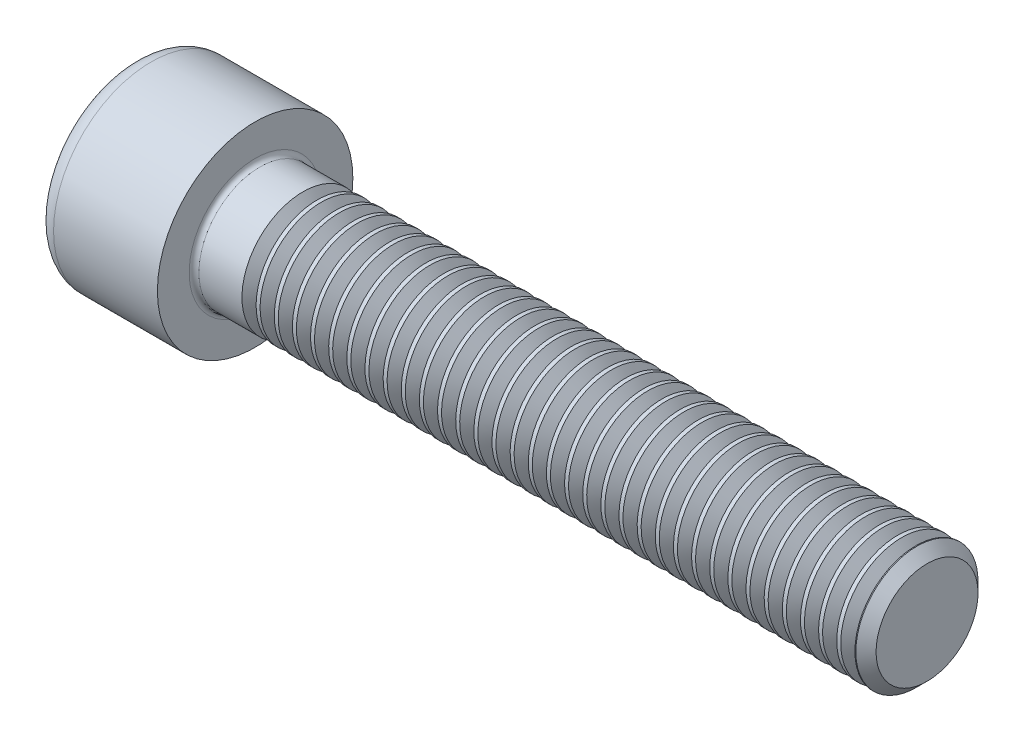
ISO-10303-21;
HEADER;
FILE_DESCRIPTION(('STEP AP214'),'2;1');
FILE_NAME('part.step','',(''),(''),'','','');
FILE_SCHEMA(('AUTOMOTIVE_DESIGN { 1 0 10303 214 1 1 1 1 }'));
ENDSEC;
DATA;
#1=APPLICATION_CONTEXT('core data for automotive mechanical design processes');
#2=APPLICATION_PROTOCOL_DEFINITION('international standard','automotive_design',2000,#1);
#3=PRODUCT_CONTEXT('',#1,'mechanical');
#4=PRODUCT('Part','Part','',(#3));
#5=PRODUCT_RELATED_PRODUCT_CATEGORY('part','',(#4));
#6=PRODUCT_DEFINITION_FORMATION('','',#4);
#7=PRODUCT_DEFINITION_CONTEXT('part definition',#1,'design');
#8=PRODUCT_DEFINITION('design','',#6,#7);
#9=PRODUCT_DEFINITION_SHAPE('','',#8);
#10=(LENGTH_UNIT() NAMED_UNIT(*) SI_UNIT(.MILLI.,.METRE.));
#11=(NAMED_UNIT(*) PLANE_ANGLE_UNIT() SI_UNIT($,.RADIAN.));
#12=(NAMED_UNIT(*) SI_UNIT($,.STERADIAN.) SOLID_ANGLE_UNIT());
#13=UNCERTAINTY_MEASURE_WITH_UNIT(LENGTH_MEASURE(1.E-05),#10,'distance_accuracy_value','');
#14=(GEOMETRIC_REPRESENTATION_CONTEXT(3) GLOBAL_UNCERTAINTY_ASSIGNED_CONTEXT((#13)) GLOBAL_UNIT_ASSIGNED_CONTEXT((#10,
#11,#12)) REPRESENTATION_CONTEXT('',''));
#15=CARTESIAN_POINT('',(0.,0.,0.));
#16=DIRECTION('',(0.,0.,1.));
#17=DIRECTION('',(1.,0.,0.));
#18=AXIS2_PLACEMENT_3D('',#15,#16,#17);
#19=CARTESIAN_POINT('',(0.,0.,0.));
#20=DIRECTION('',(-1.,0.,0.));
#21=DIRECTION('',(0.,0.,1.));
#22=AXIS2_PLACEMENT_3D('',#19,#20,#21);
#23=PLANE('',#22);
#24=DIRECTION('',(0.,-0.499999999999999,0.866025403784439));
#25=VECTOR('',#24,1.);
#26=CARTESIAN_POINT('',(0.,4.68519743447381,0.));
#27=LINE('',#26,#25);
#28=CARTESIAN_POINT('',(0.,4.68519743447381,0.));
#29=VERTEX_POINT('',#28);
#30=CARTESIAN_POINT('',(0.,2.34259871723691,4.05749999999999));
#31=VERTEX_POINT('',#30);
#32=EDGE_CURVE('E110',#29,#31,#27,.T.);
#33=ORIENTED_EDGE('',*,*,#32,.T.);
#34=DIRECTION('',(0.,1.,0.));
#35=VECTOR('',#34,1.);
#36=CARTESIAN_POINT('',(0.,-2.3425987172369,4.0575));
#37=LINE('',#36,#35);
#38=CARTESIAN_POINT('',(0.,-2.3425987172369,4.0575));
#39=VERTEX_POINT('',#38);
#40=EDGE_CURVE('E99',#39,#31,#37,.T.);
#41=ORIENTED_EDGE('',*,*,#40,.F.);
#42=DIRECTION('',(0.,-0.500000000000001,-0.866025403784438));
#43=VECTOR('',#42,1.);
#44=CARTESIAN_POINT('',(0.,-2.3425987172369,4.0575));
#45=LINE('',#44,#43);
#46=CARTESIAN_POINT('',(0.,-4.68519743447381,0.));
#47=VERTEX_POINT('',#46);
#48=EDGE_CURVE('E109',#39,#47,#45,.T.);
#49=ORIENTED_EDGE('',*,*,#48,.T.);
#50=DIRECTION('',(0.,0.499999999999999,-0.866025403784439));
#51=VECTOR('',#50,1.);
#52=CARTESIAN_POINT('',(0.,-4.68519743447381,0.));
#53=LINE('',#52,#51);
#54=CARTESIAN_POINT('',(0.,-2.34259871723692,-4.0575));
#55=VERTEX_POINT('',#54);
#56=EDGE_CURVE('E133',#47,#55,#53,.T.);
#57=ORIENTED_EDGE('',*,*,#56,.T.);
#58=DIRECTION('',(0.,-1.,0.));
#59=VECTOR('',#58,1.);
#60=CARTESIAN_POINT('',(0.,2.3425987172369,-4.0575));
#61=LINE('',#60,#59);
#62=CARTESIAN_POINT('',(0.,2.3425987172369,-4.0575));
#63=VERTEX_POINT('',#62);
#64=EDGE_CURVE('E136',#63,#55,#61,.T.);
#65=ORIENTED_EDGE('',*,*,#64,.F.);
#66=DIRECTION('',(0.,-0.500000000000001,-0.866025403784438));
#67=VECTOR('',#66,1.);
#68=CARTESIAN_POINT('',(0.,4.68519743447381,0.));
#69=LINE('',#68,#67);
#70=EDGE_CURVE('E124',#29,#63,#69,.T.);
#71=ORIENTED_EDGE('',*,*,#70,.F.);
#72=EDGE_LOOP('',(#33,#41,#49,#57,#65,#71));
#73=FACE_BOUND('',#72,.T.);
#74=CARTESIAN_POINT('',(0.,0.,0.));
#75=DIRECTION('',(-1.,0.,0.));
#76=DIRECTION('',(0.,0.,1.));
#77=AXIS2_PLACEMENT_3D('',#74,#75,#76);
#78=CIRCLE('',#77,6.5);
#79=CARTESIAN_POINT('',(0.,0.,6.5));
#80=VERTEX_POINT('',#79);
#81=EDGE_CURVE('E35',#80,#80,#78,.T.);
#82=ORIENTED_EDGE('',*,*,#81,.T.);
#83=EDGE_LOOP('',(#82));
#84=FACE_BOUND('',#83,.T.);
#85=ADVANCED_FACE('F28',(#73,#84),#23,.T.);
#86=CARTESIAN_POINT('',(-31.75,0.,0.));
#87=DIRECTION('',(-1.,0.,0.));
#88=DIRECTION('',(0.,0.,1.));
#89=AXIS2_PLACEMENT_3D('',#86,#87,#88);
#90=CYLINDRICAL_SURFACE('',#89,8.);
#91=CARTESIAN_POINT('',(1.5,0.,0.));
#92=DIRECTION('',(-1.,0.,0.));
#93=DIRECTION('',(0.,0.,1.));
#94=AXIS2_PLACEMENT_3D('',#91,#92,#93);
#95=CIRCLE('',#94,8.);
#96=CARTESIAN_POINT('',(1.5,0.,8.));
#97=VERTEX_POINT('',#96);
#98=EDGE_CURVE('E11',#97,#97,#95,.F.);
#99=ORIENTED_EDGE('',*,*,#98,.T.);
#100=EDGE_LOOP('',(#99));
#101=FACE_BOUND('',#100,.T.);
#102=CARTESIAN_POINT('',(10.,0.,0.));
#103=DIRECTION('',(-1.,0.,0.));
#104=DIRECTION('',(0.,0.,1.));
#105=AXIS2_PLACEMENT_3D('',#102,#103,#104);
#106=CIRCLE('',#105,8.);
#107=CARTESIAN_POINT('',(10.,0.,8.));
#108=VERTEX_POINT('',#107);
#109=EDGE_CURVE('E181',#108,#108,#106,.T.);
#110=ORIENTED_EDGE('',*,*,#109,.T.);
#111=EDGE_LOOP('',(#110));
#112=FACE_BOUND('',#111,.T.);
#113=ADVANCED_FACE('F208',(#101,#112),#90,.T.);
#114=CARTESIAN_POINT('',(10.,8.,0.));
#115=DIRECTION('',(1.,0.,0.));
#116=DIRECTION('',(0.,0.,-1.));
#117=AXIS2_PLACEMENT_3D('',#114,#115,#116);
#118=PLANE('',#117);
#119=CARTESIAN_POINT('',(10.,0.,0.));
#120=DIRECTION('',(1.,0.,0.));
#121=DIRECTION('',(0.,0.,-1.));
#122=AXIS2_PLACEMENT_3D('',#119,#120,#121);
#123=CIRCLE('',#122,5.39999999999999);
#124=CARTESIAN_POINT('',(10.,0.,-5.39999999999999));
#125=VERTEX_POINT('',#124);
#126=EDGE_CURVE('E184',#125,#125,#123,.F.);
#127=ORIENTED_EDGE('',*,*,#126,.T.);
#128=EDGE_LOOP('',(#127));
#129=FACE_BOUND('',#128,.T.);
#130=ORIENTED_EDGE('',*,*,#109,.F.);
#131=EDGE_LOOP('',(#130));
#132=FACE_BOUND('',#131,.T.);
#133=ADVANCED_FACE('F212',(#129,#132),#118,.T.);
#134=CARTESIAN_POINT('',(-31.75,0.,0.));
#135=DIRECTION('',(-1.,0.,0.));
#136=DIRECTION('',(0.,0.,1.));
#137=AXIS2_PLACEMENT_3D('',#134,#135,#136);
#138=CYLINDRICAL_SURFACE('',#137,4.99999999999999);
#139=CARTESIAN_POINT('',(13.9202281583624,0.,0.));
#140=DIRECTION('',(-1.,0.,0.));
#141=DIRECTION('',(0.,-1.,0.));
#142=AXIS2_PLACEMENT_3D('',#139,#140,#141);
#143=CIRCLE('',#142,5.);
#144=CARTESIAN_POINT('',(13.9202281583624,-5.,0.));
#145=VERTEX_POINT('',#144);
#146=EDGE_CURVE('E128',#145,#145,#143,.T.);
#147=ORIENTED_EDGE('',*,*,#146,.T.);
#148=EDGE_LOOP('',(#147));
#149=FACE_BOUND('',#148,.T.);
#150=CARTESIAN_POINT('',(10.4,0.,0.));
#151=DIRECTION('',(1.,0.,0.));
#152=DIRECTION('',(0.,0.,-1.));
#153=AXIS2_PLACEMENT_3D('',#150,#151,#152);
#154=CIRCLE('',#153,4.99999999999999);
#155=CARTESIAN_POINT('',(10.4,0.,-4.99999999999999));
#156=VERTEX_POINT('',#155);
#157=EDGE_CURVE('E187',#156,#156,#154,.T.);
#158=ORIENTED_EDGE('',*,*,#157,.T.);
#159=EDGE_LOOP('',(#158));
#160=FACE_BOUND('',#159,.T.);
#161=ADVANCED_FACE('F202',(#149,#160),#138,.T.);
#162=CARTESIAN_POINT('',(10.4,0.,0.));
#163=DIRECTION('',(1.,0.,0.));
#164=DIRECTION('',(0.,0.,-1.));
#165=AXIS2_PLACEMENT_3D('',#162,#163,#164);
#166=TOROIDAL_SURFACE('',#165,5.39999999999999,0.4);
#167=ORIENTED_EDGE('',*,*,#157,.F.);
#168=EDGE_LOOP('',(#167));
#169=FACE_BOUND('',#168,.T.);
#170=ORIENTED_EDGE('',*,*,#126,.F.);
#171=EDGE_LOOP('',(#170));
#172=FACE_BOUND('',#171,.T.);
#173=ADVANCED_FACE('F194',(#169,#172),#166,.F.);
#174=CARTESIAN_POINT('',(1.5,0.,0.));
#175=DIRECTION('',(-1.,0.,0.));
#176=DIRECTION('',(0.,0.,1.));
#177=AXIS2_PLACEMENT_3D('',#174,#175,#176);
#178=TOROIDAL_SURFACE('',#177,6.5,1.5);
#179=ORIENTED_EDGE('',*,*,#98,.F.);
#180=EDGE_LOOP('',(#179));
#181=FACE_BOUND('',#180,.T.);
#182=ORIENTED_EDGE('',*,*,#81,.F.);
#183=EDGE_LOOP('',(#182));
#184=FACE_BOUND('',#183,.T.);
#185=ADVANCED_FACE('F192',(#181,#184),#178,.T.);
#186=CARTESIAN_POINT('',(5.,4.68519743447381,0.));
#187=DIRECTION('',(0.,-0.866025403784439,-0.499999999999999));
#188=DIRECTION('',(0.,0.499999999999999,-0.866025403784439));
#189=AXIS2_PLACEMENT_3D('',#186,#187,#188);
#190=PLANE('',#189);
#191=ORIENTED_EDGE('',*,*,#32,.F.);
#192=DIRECTION('',(-1.,0.,0.));
#193=VECTOR('',#192,1.);
#194=CARTESIAN_POINT('',(5.,4.68519743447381,0.));
#195=LINE('',#194,#193);
#196=CARTESIAN_POINT('',(5.,4.68519743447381,0.));
#197=VERTEX_POINT('',#196);
#198=EDGE_CURVE('E159',#197,#29,#195,.T.);
#199=ORIENTED_EDGE('',*,*,#198,.F.);
#200=DIRECTION('',(0.,-0.499999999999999,0.866025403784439));
#201=VECTOR('',#200,1.);
#202=CARTESIAN_POINT('',(5.,4.68519743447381,0.));
#203=LINE('',#202,#201);
#204=CARTESIAN_POINT('',(5.,3.51389807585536,2.02874999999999));
#205=VERTEX_POINT('',#204);
#206=EDGE_CURVE('E139',#197,#205,#203,.T.);
#207=ORIENTED_EDGE('',*,*,#206,.T.);
#208=CARTESIAN_POINT('',(5.,2.34259871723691,4.05749999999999));
#209=VERTEX_POINT('',#208);
#210=EDGE_CURVE('E118',#205,#209,#203,.T.);
#211=ORIENTED_EDGE('',*,*,#210,.T.);
#212=DIRECTION('',(-1.,0.,0.));
#213=VECTOR('',#212,1.);
#214=CARTESIAN_POINT('',(5.,2.34259871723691,4.05749999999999));
#215=LINE('',#214,#213);
#216=EDGE_CURVE('E103',#209,#31,#215,.T.);
#217=ORIENTED_EDGE('',*,*,#216,.T.);
#218=EDGE_LOOP('',(#191,#199,#207,#211,#217));
#219=FACE_BOUND('',#218,.T.);
#220=ADVANCED_FACE('F114',(#219),#190,.T.);
#221=CARTESIAN_POINT('',(5.,-2.3425987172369,4.0575));
#222=DIRECTION('',(0.,0.,1.));
#223=DIRECTION('',(0.,-1.,0.));
#224=AXIS2_PLACEMENT_3D('',#221,#222,#223);
#225=PLANE('',#224);
#226=ORIENTED_EDGE('',*,*,#40,.T.);
#227=ORIENTED_EDGE('',*,*,#216,.F.);
#228=DIRECTION('',(0.,1.,0.));
#229=VECTOR('',#228,1.);
#230=CARTESIAN_POINT('',(5.,-2.3425987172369,4.0575));
#231=LINE('',#230,#229);
#232=CARTESIAN_POINT('',(5.,0.,4.0575));
#233=VERTEX_POINT('',#232);
#234=EDGE_CURVE('E141',#233,#209,#231,.T.);
#235=ORIENTED_EDGE('',*,*,#234,.F.);
#236=CARTESIAN_POINT('',(5.,-2.3425987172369,4.0575));
#237=VERTEX_POINT('',#236);
#238=EDGE_CURVE('E142',#237,#233,#231,.T.);
#239=ORIENTED_EDGE('',*,*,#238,.F.);
#240=DIRECTION('',(-1.,0.,0.));
#241=VECTOR('',#240,1.);
#242=CARTESIAN_POINT('',(5.,-2.3425987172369,4.0575));
#243=LINE('',#242,#241);
#244=EDGE_CURVE('E105',#237,#39,#243,.T.);
#245=ORIENTED_EDGE('',*,*,#244,.T.);
#246=EDGE_LOOP('',(#226,#227,#235,#239,#245));
#247=FACE_BOUND('',#246,.T.);
#248=ADVANCED_FACE('F101',(#247),#225,.F.);
#249=CARTESIAN_POINT('',(5.,-2.3425987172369,4.0575));
#250=DIRECTION('',(0.,0.866025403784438,-0.500000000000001));
#251=DIRECTION('',(0.,0.500000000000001,0.866025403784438));
#252=AXIS2_PLACEMENT_3D('',#249,#250,#251);
#253=PLANE('',#252);
#254=ORIENTED_EDGE('',*,*,#48,.F.);
#255=ORIENTED_EDGE('',*,*,#244,.F.);
#256=DIRECTION('',(0.,-0.500000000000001,-0.866025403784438));
#257=VECTOR('',#256,1.);
#258=CARTESIAN_POINT('',(5.,-2.3425987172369,4.0575));
#259=LINE('',#258,#257);
#260=CARTESIAN_POINT('',(5.,-3.51389807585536,2.02875));
#261=VERTEX_POINT('',#260);
#262=EDGE_CURVE('E146',#237,#261,#259,.T.);
#263=ORIENTED_EDGE('',*,*,#262,.T.);
#264=CARTESIAN_POINT('',(5.,-4.68519743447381,0.));
#265=VERTEX_POINT('',#264);
#266=EDGE_CURVE('E145',#261,#265,#259,.T.);
#267=ORIENTED_EDGE('',*,*,#266,.T.);
#268=DIRECTION('',(-1.,0.,0.));
#269=VECTOR('',#268,1.);
#270=CARTESIAN_POINT('',(5.,-4.68519743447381,0.));
#271=LINE('',#270,#269);
#272=EDGE_CURVE('E167',#265,#47,#271,.T.);
#273=ORIENTED_EDGE('',*,*,#272,.T.);
#274=EDGE_LOOP('',(#254,#255,#263,#267,#273));
#275=FACE_BOUND('',#274,.T.);
#276=ADVANCED_FACE('F564',(#275),#253,.T.);
#277=CARTESIAN_POINT('',(5.,-4.68519743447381,0.));
#278=DIRECTION('',(0.,0.866025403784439,0.499999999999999));
#279=DIRECTION('',(0.,-0.499999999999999,0.866025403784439));
#280=AXIS2_PLACEMENT_3D('',#277,#278,#279);
#281=PLANE('',#280);
#282=ORIENTED_EDGE('',*,*,#56,.F.);
#283=ORIENTED_EDGE('',*,*,#272,.F.);
#284=DIRECTION('',(0.,0.499999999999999,-0.866025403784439));
#285=VECTOR('',#284,1.);
#286=CARTESIAN_POINT('',(5.,-4.68519743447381,0.));
#287=LINE('',#286,#285);
#288=CARTESIAN_POINT('',(5.,-3.51389807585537,-2.02875));
#289=VERTEX_POINT('',#288);
#290=EDGE_CURVE('E150',#265,#289,#287,.T.);
#291=ORIENTED_EDGE('',*,*,#290,.T.);
#292=CARTESIAN_POINT('',(5.,-2.34259871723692,-4.0575));
#293=VERTEX_POINT('',#292);
#294=EDGE_CURVE('E149',#289,#293,#287,.T.);
#295=ORIENTED_EDGE('',*,*,#294,.T.);
#296=DIRECTION('',(-1.,0.,0.));
#297=VECTOR('',#296,1.);
#298=CARTESIAN_POINT('',(5.,-2.34259871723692,-4.0575));
#299=LINE('',#298,#297);
#300=EDGE_CURVE('E164',#293,#55,#299,.T.);
#301=ORIENTED_EDGE('',*,*,#300,.T.);
#302=EDGE_LOOP('',(#282,#283,#291,#295,#301));
#303=FACE_BOUND('',#302,.T.);
#304=ADVANCED_FACE('F560',(#303),#281,.T.);
#305=CARTESIAN_POINT('',(5.,2.3425987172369,-4.0575));
#306=DIRECTION('',(0.,0.,-1.));
#307=DIRECTION('',(0.,1.,0.));
#308=AXIS2_PLACEMENT_3D('',#305,#306,#307);
#309=PLANE('',#308);
#310=ORIENTED_EDGE('',*,*,#64,.T.);
#311=ORIENTED_EDGE('',*,*,#300,.F.);
#312=DIRECTION('',(0.,-1.,0.));
#313=VECTOR('',#312,1.);
#314=CARTESIAN_POINT('',(5.,2.3425987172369,-4.0575));
#315=LINE('',#314,#313);
#316=CARTESIAN_POINT('',(5.,0.,-4.0575));
#317=VERTEX_POINT('',#316);
#318=EDGE_CURVE('E153',#317,#293,#315,.T.);
#319=ORIENTED_EDGE('',*,*,#318,.F.);
#320=CARTESIAN_POINT('',(5.,2.3425987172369,-4.0575));
#321=VERTEX_POINT('',#320);
#322=EDGE_CURVE('E42',#321,#317,#315,.T.);
#323=ORIENTED_EDGE('',*,*,#322,.F.);
#324=DIRECTION('',(-1.,0.,0.));
#325=VECTOR('',#324,1.);
#326=CARTESIAN_POINT('',(5.,2.3425987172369,-4.0575));
#327=LINE('',#326,#325);
#328=EDGE_CURVE('E161',#321,#63,#327,.T.);
#329=ORIENTED_EDGE('',*,*,#328,.T.);
#330=EDGE_LOOP('',(#310,#311,#319,#323,#329));
#331=FACE_BOUND('',#330,.T.);
#332=ADVANCED_FACE('F556',(#331),#309,.F.);
#333=CARTESIAN_POINT('',(5.,4.68519743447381,0.));
#334=DIRECTION('',(0.,0.866025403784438,-0.500000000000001));
#335=DIRECTION('',(0.,0.500000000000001,0.866025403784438));
#336=AXIS2_PLACEMENT_3D('',#333,#334,#335);
#337=PLANE('',#336);
#338=ORIENTED_EDGE('',*,*,#70,.T.);
#339=ORIENTED_EDGE('',*,*,#328,.F.);
#340=DIRECTION('',(0.,-0.500000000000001,-0.866025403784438));
#341=VECTOR('',#340,1.);
#342=CARTESIAN_POINT('',(5.,4.68519743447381,0.));
#343=LINE('',#342,#341);
#344=CARTESIAN_POINT('',(5.,3.51389807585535,-2.02875));
#345=VERTEX_POINT('',#344);
#346=EDGE_CURVE('E155',#345,#321,#343,.T.);
#347=ORIENTED_EDGE('',*,*,#346,.F.);
#348=EDGE_CURVE('E156',#197,#345,#343,.T.);
#349=ORIENTED_EDGE('',*,*,#348,.F.);
#350=ORIENTED_EDGE('',*,*,#198,.T.);
#351=EDGE_LOOP('',(#338,#339,#347,#349,#350));
#352=FACE_BOUND('',#351,.T.);
#353=ADVANCED_FACE('F551',(#352),#337,.F.);
#354=CARTESIAN_POINT('',(5.,7.02779615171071,-4.05750000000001));
#355=DIRECTION('',(1.,0.,0.));
#356=DIRECTION('',(0.,0.,-1.));
#357=AXIS2_PLACEMENT_3D('',#354,#355,#356);
#358=PLANE('',#357);
#359=ORIENTED_EDGE('',*,*,#318,.T.);
#360=ORIENTED_EDGE('',*,*,#294,.F.);
#361=CARTESIAN_POINT('',(5.,0.,0.));
#362=DIRECTION('',(-1.,0.,0.));
#363=DIRECTION('',(0.,0.,1.));
#364=AXIS2_PLACEMENT_3D('',#361,#362,#363);
#365=CIRCLE('',#364,4.0575);
#366=EDGE_CURVE('E590',#317,#289,#365,.T.);
#367=ORIENTED_EDGE('',*,*,#366,.F.);
#368=EDGE_LOOP('',(#359,#360,#367));
#369=FACE_BOUND('',#368,.T.);
#370=ADVANCED_FACE('F547',(#369),#358,.F.);
#371=ORIENTED_EDGE('',*,*,#290,.F.);
#372=ORIENTED_EDGE('',*,*,#266,.F.);
#373=EDGE_CURVE('E588',#289,#261,#365,.T.);
#374=ORIENTED_EDGE('',*,*,#373,.F.);
#375=EDGE_LOOP('',(#371,#372,#374));
#376=FACE_BOUND('',#375,.T.);
#377=ADVANCED_FACE('F550',(#376),#358,.F.);
#378=ORIENTED_EDGE('',*,*,#262,.F.);
#379=ORIENTED_EDGE('',*,*,#238,.T.);
#380=EDGE_CURVE('E119',#261,#233,#365,.T.);
#381=ORIENTED_EDGE('',*,*,#380,.F.);
#382=EDGE_LOOP('',(#378,#379,#381));
#383=FACE_BOUND('',#382,.T.);
#384=ADVANCED_FACE('F584',(#383),#358,.F.);
#385=ORIENTED_EDGE('',*,*,#234,.T.);
#386=ORIENTED_EDGE('',*,*,#210,.F.);
#387=EDGE_CURVE('E171',#233,#205,#365,.T.);
#388=ORIENTED_EDGE('',*,*,#387,.F.);
#389=EDGE_LOOP('',(#385,#386,#388));
#390=FACE_BOUND('',#389,.T.);
#391=ADVANCED_FACE('F581',(#390),#358,.F.);
#392=ORIENTED_EDGE('',*,*,#206,.F.);
#393=ORIENTED_EDGE('',*,*,#348,.T.);
#394=EDGE_CURVE('E175',#205,#345,#365,.T.);
#395=ORIENTED_EDGE('',*,*,#394,.F.);
#396=EDGE_LOOP('',(#392,#393,#395));
#397=FACE_BOUND('',#396,.T.);
#398=ADVANCED_FACE('F574',(#397),#358,.F.);
#399=ORIENTED_EDGE('',*,*,#346,.T.);
#400=ORIENTED_EDGE('',*,*,#322,.T.);
#401=EDGE_CURVE('E594',#345,#317,#365,.T.);
#402=ORIENTED_EDGE('',*,*,#401,.F.);
#403=EDGE_LOOP('',(#399,#400,#402));
#404=FACE_BOUND('',#403,.T.);
#405=ADVANCED_FACE('F553',(#404),#358,.F.);
#406=CARTESIAN_POINT('',(5.,0.,0.));
#407=DIRECTION('',(-1.,0.,0.));
#408=DIRECTION('',(0.,0.,1.));
#409=AXIS2_PLACEMENT_3D('',#406,#407,#408);
#410=CONICAL_SURFACE('',#409,4.0575,1.04719755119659);
#411=CARTESIAN_POINT('',(7.34259871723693,0.,0.));
#412=VERTEX_POINT('',#411);
#413=VERTEX_LOOP('',#412);
#414=FACE_BOUND('',#413,.T.);
#415=ORIENTED_EDGE('',*,*,#387,.T.);
#416=ORIENTED_EDGE('',*,*,#394,.T.);
#417=ORIENTED_EDGE('',*,*,#401,.T.);
#418=ORIENTED_EDGE('',*,*,#366,.T.);
#419=ORIENTED_EDGE('',*,*,#373,.T.);
#420=ORIENTED_EDGE('',*,*,#380,.T.);
#421=EDGE_LOOP('',(#415,#416,#417,#418,#419,#420));
#422=FACE_BOUND('',#421,.T.);
#423=ADVANCED_FACE('F545',(#414,#422),#410,.F.);
#424=CARTESIAN_POINT('',(15.0797718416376,0.,0.));
#425=DIRECTION('',(1.,0.,0.));
#426=DIRECTION('',(0.,1.,0.));
#427=AXIS2_PLACEMENT_3D('',#424,#425,#426);
#428=CONICAL_SURFACE('',#427,5.,0.959931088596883);
#429=CARTESIAN_POINT('',(14.5,0.,0.));
#430=DIRECTION('',(-1.,0.,0.));
#431=DIRECTION('',(0.,-1.,0.));
#432=AXIS2_PLACEMENT_3D('',#429,#430,#431);
#433=CIRCLE('',#432,4.172);
#434=CARTESIAN_POINT('',(14.5,-4.172,0.));
#435=VERTEX_POINT('',#434);
#436=EDGE_CURVE('E1701',#435,#435,#433,.T.);
#437=ORIENTED_EDGE('',*,*,#436,.F.);
#438=EDGE_LOOP('',(#437));
#439=FACE_BOUND('',#438,.T.);
#440=CARTESIAN_POINT('',(15.0797718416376,0.,0.));
#441=DIRECTION('',(-1.,0.,0.));
#442=DIRECTION('',(0.,-1.,0.));
#443=AXIS2_PLACEMENT_3D('',#440,#441,#442);
#444=CIRCLE('',#443,5.);
#445=CARTESIAN_POINT('',(15.0797718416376,-5.,0.));
#446=VERTEX_POINT('',#445);
#447=EDGE_CURVE('E125',#446,#446,#444,.T.);
#448=ORIENTED_EDGE('',*,*,#447,.T.);
#449=EDGE_LOOP('',(#448));
#450=FACE_BOUND('',#449,.T.);
#451=ADVANCED_FACE('F541',(#439,#450),#428,.T.);
#452=CARTESIAN_POINT('',(14.5,0.,0.));
#453=DIRECTION('',(-1.,0.,0.));
#454=DIRECTION('',(0.,-1.,0.));
#455=AXIS2_PLACEMENT_3D('',#452,#453,#454);
#456=CONICAL_SURFACE('',#455,4.172,0.959931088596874);
#457=ORIENTED_EDGE('',*,*,#146,.F.);
#458=EDGE_LOOP('',(#457));
#459=FACE_BOUND('',#458,.T.);
#460=ORIENTED_EDGE('',*,*,#436,.T.);
#461=EDGE_LOOP('',(#460));
#462=FACE_BOUND('',#461,.T.);
#463=ADVANCED_FACE('F538',(#459,#462),#456,.T.);
#464=CARTESIAN_POINT('',(15.4055222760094,0.,0.));
#465=DIRECTION('',(-1.,0.,0.));
#466=DIRECTION('',(0.,-1.,0.));
#467=AXIS2_PLACEMENT_3D('',#464,#465,#466);
#468=CIRCLE('',#467,5.);
#469=CARTESIAN_POINT('',(15.4055222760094,-5.,0.));
#470=VERTEX_POINT('',#469);
#471=EDGE_CURVE('E1695',#470,#470,#468,.T.);
#472=ORIENTED_EDGE('',*,*,#471,.T.);
#473=EDGE_LOOP('',(#472));
#474=FACE_BOUND('',#473,.T.);
#475=ORIENTED_EDGE('',*,*,#447,.F.);
#476=EDGE_LOOP('',(#475));
#477=FACE_BOUND('',#476,.T.);
#478=ADVANCED_FACE('F225',(#474,#477),#138,.T.);
#479=CARTESIAN_POINT('',(16.5650659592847,0.,0.));
#480=DIRECTION('',(1.,0.,0.));
#481=DIRECTION('',(0.,1.,0.));
#482=AXIS2_PLACEMENT_3D('',#479,#480,#481);
#483=CONICAL_SURFACE('',#482,5.,0.959931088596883);
#484=CARTESIAN_POINT('',(15.9852941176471,0.,0.));
#485=DIRECTION('',(-1.,0.,0.));
#486=DIRECTION('',(0.,-1.,0.));
#487=AXIS2_PLACEMENT_3D('',#484,#485,#486);
#488=CIRCLE('',#487,4.172);
#489=CARTESIAN_POINT('',(15.9852941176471,-4.172,0.));
#490=VERTEX_POINT('',#489);
#491=EDGE_CURVE('E1692',#490,#490,#488,.T.);
#492=ORIENTED_EDGE('',*,*,#491,.F.);
#493=EDGE_LOOP('',(#492));
#494=FACE_BOUND('',#493,.T.);
#495=CARTESIAN_POINT('',(16.5650659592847,0.,0.));
#496=DIRECTION('',(-1.,0.,0.));
#497=DIRECTION('',(0.,-1.,0.));
#498=AXIS2_PLACEMENT_3D('',#495,#496,#497);
#499=CIRCLE('',#498,5.);
#500=CARTESIAN_POINT('',(16.5650659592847,-5.,0.));
#501=VERTEX_POINT('',#500);
#502=EDGE_CURVE('E1698',#501,#501,#499,.T.);
#503=ORIENTED_EDGE('',*,*,#502,.T.);
#504=EDGE_LOOP('',(#503));
#505=FACE_BOUND('',#504,.T.);
#506=ADVANCED_FACE('F533',(#494,#505),#483,.T.);
#507=CARTESIAN_POINT('',(15.9852941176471,0.,0.));
#508=DIRECTION('',(-1.,0.,0.));
#509=DIRECTION('',(0.,-1.,0.));
#510=AXIS2_PLACEMENT_3D('',#507,#508,#509);
#511=CONICAL_SURFACE('',#510,4.172,0.959931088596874);
#512=ORIENTED_EDGE('',*,*,#471,.F.);
#513=EDGE_LOOP('',(#512));
#514=FACE_BOUND('',#513,.T.);
#515=ORIENTED_EDGE('',*,*,#491,.T.);
#516=EDGE_LOOP('',(#515));
#517=FACE_BOUND('',#516,.T.);
#518=ADVANCED_FACE('F530',(#514,#517),#511,.T.);
#519=CARTESIAN_POINT('',(16.8908163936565,0.,0.));
#520=DIRECTION('',(-1.,0.,0.));
#521=DIRECTION('',(0.,-1.,0.));
#522=AXIS2_PLACEMENT_3D('',#519,#520,#521);
#523=CIRCLE('',#522,5.);
#524=CARTESIAN_POINT('',(16.8908163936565,-5.,0.));
#525=VERTEX_POINT('',#524);
#526=EDGE_CURVE('E1686',#525,#525,#523,.T.);
#527=ORIENTED_EDGE('',*,*,#526,.T.);
#528=EDGE_LOOP('',(#527));
#529=FACE_BOUND('',#528,.T.);
#530=ORIENTED_EDGE('',*,*,#502,.F.);
#531=EDGE_LOOP('',(#530));
#532=FACE_BOUND('',#531,.T.);
#533=ADVANCED_FACE('F528',(#529,#532),#138,.T.);
#534=CARTESIAN_POINT('',(18.0503600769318,0.,0.));
#535=DIRECTION('',(1.,0.,0.));
#536=DIRECTION('',(0.,1.,0.));
#537=AXIS2_PLACEMENT_3D('',#534,#535,#536);
#538=CONICAL_SURFACE('',#537,5.,0.959931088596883);
#539=CARTESIAN_POINT('',(17.4705882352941,0.,0.));
#540=DIRECTION('',(-1.,0.,0.));
#541=DIRECTION('',(0.,-1.,0.));
#542=AXIS2_PLACEMENT_3D('',#539,#540,#541);
#543=CIRCLE('',#542,4.172);
#544=CARTESIAN_POINT('',(17.4705882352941,-4.172,0.));
#545=VERTEX_POINT('',#544);
#546=EDGE_CURVE('E1683',#545,#545,#543,.T.);
#547=ORIENTED_EDGE('',*,*,#546,.F.);
#548=EDGE_LOOP('',(#547));
#549=FACE_BOUND('',#548,.T.);
#550=CARTESIAN_POINT('',(18.0503600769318,0.,0.));
#551=DIRECTION('',(-1.,0.,0.));
#552=DIRECTION('',(0.,-1.,0.));
#553=AXIS2_PLACEMENT_3D('',#550,#551,#552);
#554=CIRCLE('',#553,5.);
#555=CARTESIAN_POINT('',(18.0503600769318,-5.,0.));
#556=VERTEX_POINT('',#555);
#557=EDGE_CURVE('E1689',#556,#556,#554,.T.);
#558=ORIENTED_EDGE('',*,*,#557,.T.);
#559=EDGE_LOOP('',(#558));
#560=FACE_BOUND('',#559,.T.);
#561=ADVANCED_FACE('F524',(#549,#560),#538,.T.);
#562=CARTESIAN_POINT('',(17.4705882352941,0.,0.));
#563=DIRECTION('',(-1.,0.,0.));
#564=DIRECTION('',(0.,-1.,0.));
#565=AXIS2_PLACEMENT_3D('',#562,#563,#564);
#566=CONICAL_SURFACE('',#565,4.172,0.959931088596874);
#567=ORIENTED_EDGE('',*,*,#526,.F.);
#568=EDGE_LOOP('',(#567));
#569=FACE_BOUND('',#568,.T.);
#570=ORIENTED_EDGE('',*,*,#546,.T.);
#571=EDGE_LOOP('',(#570));
#572=FACE_BOUND('',#571,.T.);
#573=ADVANCED_FACE('F521',(#569,#572),#566,.T.);
#574=CARTESIAN_POINT('',(18.3761105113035,0.,0.));
#575=DIRECTION('',(-1.,0.,0.));
#576=DIRECTION('',(0.,-1.,0.));
#577=AXIS2_PLACEMENT_3D('',#574,#575,#576);
#578=CIRCLE('',#577,5.);
#579=CARTESIAN_POINT('',(18.3761105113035,-5.,0.));
#580=VERTEX_POINT('',#579);
#581=EDGE_CURVE('E1677',#580,#580,#578,.T.);
#582=ORIENTED_EDGE('',*,*,#581,.T.);
#583=EDGE_LOOP('',(#582));
#584=FACE_BOUND('',#583,.T.);
#585=ORIENTED_EDGE('',*,*,#557,.F.);
#586=EDGE_LOOP('',(#585));
#587=FACE_BOUND('',#586,.T.);
#588=ADVANCED_FACE('F519',(#584,#587),#138,.T.);
#589=CARTESIAN_POINT('',(19.5356541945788,0.,0.));
#590=DIRECTION('',(1.,0.,0.));
#591=DIRECTION('',(0.,1.,0.));
#592=AXIS2_PLACEMENT_3D('',#589,#590,#591);
#593=CONICAL_SURFACE('',#592,5.,0.959931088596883);
#594=CARTESIAN_POINT('',(18.9558823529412,0.,0.));
#595=DIRECTION('',(-1.,0.,0.));
#596=DIRECTION('',(0.,-1.,0.));
#597=AXIS2_PLACEMENT_3D('',#594,#595,#596);
#598=CIRCLE('',#597,4.172);
#599=CARTESIAN_POINT('',(18.9558823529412,-4.172,0.));
#600=VERTEX_POINT('',#599);
#601=EDGE_CURVE('E1674',#600,#600,#598,.T.);
#602=ORIENTED_EDGE('',*,*,#601,.F.);
#603=EDGE_LOOP('',(#602));
#604=FACE_BOUND('',#603,.T.);
#605=CARTESIAN_POINT('',(19.5356541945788,0.,0.));
#606=DIRECTION('',(-1.,0.,0.));
#607=DIRECTION('',(0.,-1.,0.));
#608=AXIS2_PLACEMENT_3D('',#605,#606,#607);
#609=CIRCLE('',#608,5.);
#610=CARTESIAN_POINT('',(19.5356541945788,-5.,0.));
#611=VERTEX_POINT('',#610);
#612=EDGE_CURVE('E1680',#611,#611,#609,.T.);
#613=ORIENTED_EDGE('',*,*,#612,.T.);
#614=EDGE_LOOP('',(#613));
#615=FACE_BOUND('',#614,.T.);
#616=ADVANCED_FACE('F515',(#604,#615),#593,.T.);
#617=CARTESIAN_POINT('',(18.9558823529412,0.,0.));
#618=DIRECTION('',(-1.,0.,0.));
#619=DIRECTION('',(0.,-1.,0.));
#620=AXIS2_PLACEMENT_3D('',#617,#618,#619);
#621=CONICAL_SURFACE('',#620,4.172,0.959931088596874);
#622=ORIENTED_EDGE('',*,*,#581,.F.);
#623=EDGE_LOOP('',(#622));
#624=FACE_BOUND('',#623,.T.);
#625=ORIENTED_EDGE('',*,*,#601,.T.);
#626=EDGE_LOOP('',(#625));
#627=FACE_BOUND('',#626,.T.);
#628=ADVANCED_FACE('F512',(#624,#627),#621,.T.);
#629=CARTESIAN_POINT('',(19.8614046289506,0.,0.));
#630=DIRECTION('',(-1.,0.,0.));
#631=DIRECTION('',(0.,-1.,0.));
#632=AXIS2_PLACEMENT_3D('',#629,#630,#631);
#633=CIRCLE('',#632,5.);
#634=CARTESIAN_POINT('',(19.8614046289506,-5.,0.));
#635=VERTEX_POINT('',#634);
#636=EDGE_CURVE('E1668',#635,#635,#633,.T.);
#637=ORIENTED_EDGE('',*,*,#636,.T.);
#638=EDGE_LOOP('',(#637));
#639=FACE_BOUND('',#638,.T.);
#640=ORIENTED_EDGE('',*,*,#612,.F.);
#641=EDGE_LOOP('',(#640));
#642=FACE_BOUND('',#641,.T.);
#643=ADVANCED_FACE('F510',(#639,#642),#138,.T.);
#644=CARTESIAN_POINT('',(21.0209483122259,0.,0.));
#645=DIRECTION('',(1.,0.,0.));
#646=DIRECTION('',(0.,1.,0.));
#647=AXIS2_PLACEMENT_3D('',#644,#645,#646);
#648=CONICAL_SURFACE('',#647,5.,0.959931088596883);
#649=CARTESIAN_POINT('',(20.4411764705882,0.,0.));
#650=DIRECTION('',(-1.,0.,0.));
#651=DIRECTION('',(0.,-1.,0.));
#652=AXIS2_PLACEMENT_3D('',#649,#650,#651);
#653=CIRCLE('',#652,4.172);
#654=CARTESIAN_POINT('',(20.4411764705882,-4.172,0.));
#655=VERTEX_POINT('',#654);
#656=EDGE_CURVE('E1665',#655,#655,#653,.T.);
#657=ORIENTED_EDGE('',*,*,#656,.F.);
#658=EDGE_LOOP('',(#657));
#659=FACE_BOUND('',#658,.T.);
#660=CARTESIAN_POINT('',(21.0209483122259,0.,0.));
#661=DIRECTION('',(-1.,0.,0.));
#662=DIRECTION('',(0.,-1.,0.));
#663=AXIS2_PLACEMENT_3D('',#660,#661,#662);
#664=CIRCLE('',#663,5.);
#665=CARTESIAN_POINT('',(21.0209483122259,-5.,0.));
#666=VERTEX_POINT('',#665);
#667=EDGE_CURVE('E1671',#666,#666,#664,.T.);
#668=ORIENTED_EDGE('',*,*,#667,.T.);
#669=EDGE_LOOP('',(#668));
#670=FACE_BOUND('',#669,.T.);
#671=ADVANCED_FACE('F506',(#659,#670),#648,.T.);
#672=CARTESIAN_POINT('',(20.4411764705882,0.,0.));
#673=DIRECTION('',(-1.,0.,0.));
#674=DIRECTION('',(0.,-1.,0.));
#675=AXIS2_PLACEMENT_3D('',#672,#673,#674);
#676=CONICAL_SURFACE('',#675,4.172,0.959931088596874);
#677=ORIENTED_EDGE('',*,*,#636,.F.);
#678=EDGE_LOOP('',(#677));
#679=FACE_BOUND('',#678,.T.);
#680=ORIENTED_EDGE('',*,*,#656,.T.);
#681=EDGE_LOOP('',(#680));
#682=FACE_BOUND('',#681,.T.);
#683=ADVANCED_FACE('F503',(#679,#682),#676,.T.);
#684=CARTESIAN_POINT('',(21.3466987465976,0.,0.));
#685=DIRECTION('',(-1.,0.,0.));
#686=DIRECTION('',(0.,-1.,0.));
#687=AXIS2_PLACEMENT_3D('',#684,#685,#686);
#688=CIRCLE('',#687,5.);
#689=CARTESIAN_POINT('',(21.3466987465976,-5.,0.));
#690=VERTEX_POINT('',#689);
#691=EDGE_CURVE('E1659',#690,#690,#688,.T.);
#692=ORIENTED_EDGE('',*,*,#691,.T.);
#693=EDGE_LOOP('',(#692));
#694=FACE_BOUND('',#693,.T.);
#695=ORIENTED_EDGE('',*,*,#667,.F.);
#696=EDGE_LOOP('',(#695));
#697=FACE_BOUND('',#696,.T.);
#698=ADVANCED_FACE('F501',(#694,#697),#138,.T.);
#699=CARTESIAN_POINT('',(22.5062424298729,0.,0.));
#700=DIRECTION('',(1.,0.,0.));
#701=DIRECTION('',(0.,1.,0.));
#702=AXIS2_PLACEMENT_3D('',#699,#700,#701);
#703=CONICAL_SURFACE('',#702,5.,0.959931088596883);
#704=CARTESIAN_POINT('',(21.9264705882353,0.,0.));
#705=DIRECTION('',(-1.,0.,0.));
#706=DIRECTION('',(0.,-1.,0.));
#707=AXIS2_PLACEMENT_3D('',#704,#705,#706);
#708=CIRCLE('',#707,4.172);
#709=CARTESIAN_POINT('',(21.9264705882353,-4.172,0.));
#710=VERTEX_POINT('',#709);
#711=EDGE_CURVE('E1656',#710,#710,#708,.T.);
#712=ORIENTED_EDGE('',*,*,#711,.F.);
#713=EDGE_LOOP('',(#712));
#714=FACE_BOUND('',#713,.T.);
#715=CARTESIAN_POINT('',(22.5062424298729,0.,0.));
#716=DIRECTION('',(-1.,0.,0.));
#717=DIRECTION('',(0.,-1.,0.));
#718=AXIS2_PLACEMENT_3D('',#715,#716,#717);
#719=CIRCLE('',#718,5.);
#720=CARTESIAN_POINT('',(22.5062424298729,-5.,0.));
#721=VERTEX_POINT('',#720);
#722=EDGE_CURVE('E1662',#721,#721,#719,.T.);
#723=ORIENTED_EDGE('',*,*,#722,.T.);
#724=EDGE_LOOP('',(#723));
#725=FACE_BOUND('',#724,.T.);
#726=ADVANCED_FACE('F497',(#714,#725),#703,.T.);
#727=CARTESIAN_POINT('',(21.9264705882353,0.,0.));
#728=DIRECTION('',(-1.,0.,0.));
#729=DIRECTION('',(0.,-1.,0.));
#730=AXIS2_PLACEMENT_3D('',#727,#728,#729);
#731=CONICAL_SURFACE('',#730,4.172,0.959931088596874);
#732=ORIENTED_EDGE('',*,*,#691,.F.);
#733=EDGE_LOOP('',(#732));
#734=FACE_BOUND('',#733,.T.);
#735=ORIENTED_EDGE('',*,*,#711,.T.);
#736=EDGE_LOOP('',(#735));
#737=FACE_BOUND('',#736,.T.);
#738=ADVANCED_FACE('F494',(#734,#737),#731,.T.);
#739=CARTESIAN_POINT('',(22.8319928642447,0.,0.));
#740=DIRECTION('',(-1.,0.,0.));
#741=DIRECTION('',(0.,-1.,0.));
#742=AXIS2_PLACEMENT_3D('',#739,#740,#741);
#743=CIRCLE('',#742,5.);
#744=CARTESIAN_POINT('',(22.8319928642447,-5.,0.));
#745=VERTEX_POINT('',#744);
#746=EDGE_CURVE('E1650',#745,#745,#743,.T.);
#747=ORIENTED_EDGE('',*,*,#746,.T.);
#748=EDGE_LOOP('',(#747));
#749=FACE_BOUND('',#748,.T.);
#750=ORIENTED_EDGE('',*,*,#722,.F.);
#751=EDGE_LOOP('',(#750));
#752=FACE_BOUND('',#751,.T.);
#753=ADVANCED_FACE('F492',(#749,#752),#138,.T.);
#754=CARTESIAN_POINT('',(23.99153654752,0.,0.));
#755=DIRECTION('',(1.,0.,0.));
#756=DIRECTION('',(0.,1.,0.));
#757=AXIS2_PLACEMENT_3D('',#754,#755,#756);
#758=CONICAL_SURFACE('',#757,5.,0.959931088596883);
#759=CARTESIAN_POINT('',(23.4117647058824,0.,0.));
#760=DIRECTION('',(-1.,0.,0.));
#761=DIRECTION('',(0.,-1.,0.));
#762=AXIS2_PLACEMENT_3D('',#759,#760,#761);
#763=CIRCLE('',#762,4.172);
#764=CARTESIAN_POINT('',(23.4117647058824,-4.172,0.));
#765=VERTEX_POINT('',#764);
#766=EDGE_CURVE('E1647',#765,#765,#763,.T.);
#767=ORIENTED_EDGE('',*,*,#766,.F.);
#768=EDGE_LOOP('',(#767));
#769=FACE_BOUND('',#768,.T.);
#770=CARTESIAN_POINT('',(23.99153654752,0.,0.));
#771=DIRECTION('',(-1.,0.,0.));
#772=DIRECTION('',(0.,-1.,0.));
#773=AXIS2_PLACEMENT_3D('',#770,#771,#772);
#774=CIRCLE('',#773,5.);
#775=CARTESIAN_POINT('',(23.99153654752,-5.,0.));
#776=VERTEX_POINT('',#775);
#777=EDGE_CURVE('E1653',#776,#776,#774,.T.);
#778=ORIENTED_EDGE('',*,*,#777,.T.);
#779=EDGE_LOOP('',(#778));
#780=FACE_BOUND('',#779,.T.);
#781=ADVANCED_FACE('F488',(#769,#780),#758,.T.);
#782=CARTESIAN_POINT('',(23.4117647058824,0.,0.));
#783=DIRECTION('',(-1.,0.,0.));
#784=DIRECTION('',(0.,-1.,0.));
#785=AXIS2_PLACEMENT_3D('',#782,#783,#784);
#786=CONICAL_SURFACE('',#785,4.172,0.959931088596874);
#787=ORIENTED_EDGE('',*,*,#746,.F.);
#788=EDGE_LOOP('',(#787));
#789=FACE_BOUND('',#788,.T.);
#790=ORIENTED_EDGE('',*,*,#766,.T.);
#791=EDGE_LOOP('',(#790));
#792=FACE_BOUND('',#791,.T.);
#793=ADVANCED_FACE('F485',(#789,#792),#786,.T.);
#794=CARTESIAN_POINT('',(24.3172869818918,0.,0.));
#795=DIRECTION('',(-1.,0.,0.));
#796=DIRECTION('',(0.,-1.,0.));
#797=AXIS2_PLACEMENT_3D('',#794,#795,#796);
#798=CIRCLE('',#797,5.);
#799=CARTESIAN_POINT('',(24.3172869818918,-5.,0.));
#800=VERTEX_POINT('',#799);
#801=EDGE_CURVE('E1641',#800,#800,#798,.T.);
#802=ORIENTED_EDGE('',*,*,#801,.T.);
#803=EDGE_LOOP('',(#802));
#804=FACE_BOUND('',#803,.T.);
#805=ORIENTED_EDGE('',*,*,#777,.F.);
#806=EDGE_LOOP('',(#805));
#807=FACE_BOUND('',#806,.T.);
#808=ADVANCED_FACE('F483',(#804,#807),#138,.T.);
#809=CARTESIAN_POINT('',(25.4768306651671,0.,0.));
#810=DIRECTION('',(1.,0.,0.));
#811=DIRECTION('',(0.,1.,0.));
#812=AXIS2_PLACEMENT_3D('',#809,#810,#811);
#813=CONICAL_SURFACE('',#812,5.,0.959931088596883);
#814=CARTESIAN_POINT('',(24.8970588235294,0.,0.));
#815=DIRECTION('',(-1.,0.,0.));
#816=DIRECTION('',(0.,-1.,0.));
#817=AXIS2_PLACEMENT_3D('',#814,#815,#816);
#818=CIRCLE('',#817,4.172);
#819=CARTESIAN_POINT('',(24.8970588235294,-4.172,0.));
#820=VERTEX_POINT('',#819);
#821=EDGE_CURVE('E1638',#820,#820,#818,.T.);
#822=ORIENTED_EDGE('',*,*,#821,.F.);
#823=EDGE_LOOP('',(#822));
#824=FACE_BOUND('',#823,.T.);
#825=CARTESIAN_POINT('',(25.4768306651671,0.,0.));
#826=DIRECTION('',(-1.,0.,0.));
#827=DIRECTION('',(0.,-1.,0.));
#828=AXIS2_PLACEMENT_3D('',#825,#826,#827);
#829=CIRCLE('',#828,5.);
#830=CARTESIAN_POINT('',(25.4768306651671,-5.,0.));
#831=VERTEX_POINT('',#830);
#832=EDGE_CURVE('E1644',#831,#831,#829,.T.);
#833=ORIENTED_EDGE('',*,*,#832,.T.);
#834=EDGE_LOOP('',(#833));
#835=FACE_BOUND('',#834,.T.);
#836=ADVANCED_FACE('F479',(#824,#835),#813,.T.);
#837=CARTESIAN_POINT('',(24.8970588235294,0.,0.));
#838=DIRECTION('',(-1.,0.,0.));
#839=DIRECTION('',(0.,-1.,0.));
#840=AXIS2_PLACEMENT_3D('',#837,#838,#839);
#841=CONICAL_SURFACE('',#840,4.172,0.959931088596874);
#842=ORIENTED_EDGE('',*,*,#801,.F.);
#843=EDGE_LOOP('',(#842));
#844=FACE_BOUND('',#843,.T.);
#845=ORIENTED_EDGE('',*,*,#821,.T.);
#846=EDGE_LOOP('',(#845));
#847=FACE_BOUND('',#846,.T.);
#848=ADVANCED_FACE('F476',(#844,#847),#841,.T.);
#849=CARTESIAN_POINT('',(25.8025810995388,0.,0.));
#850=DIRECTION('',(-1.,0.,0.));
#851=DIRECTION('',(0.,-1.,0.));
#852=AXIS2_PLACEMENT_3D('',#849,#850,#851);
#853=CIRCLE('',#852,5.);
#854=CARTESIAN_POINT('',(25.8025810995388,-5.,0.));
#855=VERTEX_POINT('',#854);
#856=EDGE_CURVE('E1632',#855,#855,#853,.T.);
#857=ORIENTED_EDGE('',*,*,#856,.T.);
#858=EDGE_LOOP('',(#857));
#859=FACE_BOUND('',#858,.T.);
#860=ORIENTED_EDGE('',*,*,#832,.F.);
#861=EDGE_LOOP('',(#860));
#862=FACE_BOUND('',#861,.T.);
#863=ADVANCED_FACE('F474',(#859,#862),#138,.T.);
#864=CARTESIAN_POINT('',(26.9621247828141,0.,0.));
#865=DIRECTION('',(1.,0.,0.));
#866=DIRECTION('',(0.,1.,0.));
#867=AXIS2_PLACEMENT_3D('',#864,#865,#866);
#868=CONICAL_SURFACE('',#867,5.,0.959931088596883);
#869=CARTESIAN_POINT('',(26.3823529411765,0.,0.));
#870=DIRECTION('',(-1.,0.,0.));
#871=DIRECTION('',(0.,-1.,0.));
#872=AXIS2_PLACEMENT_3D('',#869,#870,#871);
#873=CIRCLE('',#872,4.172);
#874=CARTESIAN_POINT('',(26.3823529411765,-4.172,0.));
#875=VERTEX_POINT('',#874);
#876=EDGE_CURVE('E1629',#875,#875,#873,.T.);
#877=ORIENTED_EDGE('',*,*,#876,.F.);
#878=EDGE_LOOP('',(#877));
#879=FACE_BOUND('',#878,.T.);
#880=CARTESIAN_POINT('',(26.9621247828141,0.,0.));
#881=DIRECTION('',(-1.,0.,0.));
#882=DIRECTION('',(0.,-1.,0.));
#883=AXIS2_PLACEMENT_3D('',#880,#881,#882);
#884=CIRCLE('',#883,5.);
#885=CARTESIAN_POINT('',(26.9621247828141,-5.,0.));
#886=VERTEX_POINT('',#885);
#887=EDGE_CURVE('E1635',#886,#886,#884,.T.);
#888=ORIENTED_EDGE('',*,*,#887,.T.);
#889=EDGE_LOOP('',(#888));
#890=FACE_BOUND('',#889,.T.);
#891=ADVANCED_FACE('F470',(#879,#890),#868,.T.);
#892=CARTESIAN_POINT('',(26.3823529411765,0.,0.));
#893=DIRECTION('',(-1.,0.,0.));
#894=DIRECTION('',(0.,-1.,0.));
#895=AXIS2_PLACEMENT_3D('',#892,#893,#894);
#896=CONICAL_SURFACE('',#895,4.172,0.959931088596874);
#897=ORIENTED_EDGE('',*,*,#856,.F.);
#898=EDGE_LOOP('',(#897));
#899=FACE_BOUND('',#898,.T.);
#900=ORIENTED_EDGE('',*,*,#876,.T.);
#901=EDGE_LOOP('',(#900));
#902=FACE_BOUND('',#901,.T.);
#903=ADVANCED_FACE('F467',(#899,#902),#896,.T.);
#904=CARTESIAN_POINT('',(27.2878752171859,0.,0.));
#905=DIRECTION('',(-1.,0.,0.));
#906=DIRECTION('',(0.,-1.,0.));
#907=AXIS2_PLACEMENT_3D('',#904,#905,#906);
#908=CIRCLE('',#907,5.);
#909=CARTESIAN_POINT('',(27.2878752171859,-5.,0.));
#910=VERTEX_POINT('',#909);
#911=EDGE_CURVE('E1623',#910,#910,#908,.T.);
#912=ORIENTED_EDGE('',*,*,#911,.T.);
#913=EDGE_LOOP('',(#912));
#914=FACE_BOUND('',#913,.T.);
#915=ORIENTED_EDGE('',*,*,#887,.F.);
#916=EDGE_LOOP('',(#915));
#917=FACE_BOUND('',#916,.T.);
#918=ADVANCED_FACE('F465',(#914,#917),#138,.T.);
#919=CARTESIAN_POINT('',(28.4474189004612,0.,0.));
#920=DIRECTION('',(1.,0.,0.));
#921=DIRECTION('',(0.,1.,0.));
#922=AXIS2_PLACEMENT_3D('',#919,#920,#921);
#923=CONICAL_SURFACE('',#922,5.,0.959931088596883);
#924=CARTESIAN_POINT('',(27.8676470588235,0.,0.));
#925=DIRECTION('',(-1.,0.,0.));
#926=DIRECTION('',(0.,-1.,0.));
#927=AXIS2_PLACEMENT_3D('',#924,#925,#926);
#928=CIRCLE('',#927,4.172);
#929=CARTESIAN_POINT('',(27.8676470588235,-4.172,0.));
#930=VERTEX_POINT('',#929);
#931=EDGE_CURVE('E1620',#930,#930,#928,.T.);
#932=ORIENTED_EDGE('',*,*,#931,.F.);
#933=EDGE_LOOP('',(#932));
#934=FACE_BOUND('',#933,.T.);
#935=CARTESIAN_POINT('',(28.4474189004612,0.,0.));
#936=DIRECTION('',(-1.,0.,0.));
#937=DIRECTION('',(0.,-1.,0.));
#938=AXIS2_PLACEMENT_3D('',#935,#936,#937);
#939=CIRCLE('',#938,5.);
#940=CARTESIAN_POINT('',(28.4474189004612,-5.,0.));
#941=VERTEX_POINT('',#940);
#942=EDGE_CURVE('E1626',#941,#941,#939,.T.);
#943=ORIENTED_EDGE('',*,*,#942,.T.);
#944=EDGE_LOOP('',(#943));
#945=FACE_BOUND('',#944,.T.);
#946=ADVANCED_FACE('F461',(#934,#945),#923,.T.);
#947=CARTESIAN_POINT('',(27.8676470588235,0.,0.));
#948=DIRECTION('',(-1.,0.,0.));
#949=DIRECTION('',(0.,-1.,0.));
#950=AXIS2_PLACEMENT_3D('',#947,#948,#949);
#951=CONICAL_SURFACE('',#950,4.172,0.959931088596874);
#952=ORIENTED_EDGE('',*,*,#911,.F.);
#953=EDGE_LOOP('',(#952));
#954=FACE_BOUND('',#953,.T.);
#955=ORIENTED_EDGE('',*,*,#931,.T.);
#956=EDGE_LOOP('',(#955));
#957=FACE_BOUND('',#956,.T.);
#958=ADVANCED_FACE('F458',(#954,#957),#951,.T.);
#959=CARTESIAN_POINT('',(28.7731693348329,0.,0.));
#960=DIRECTION('',(-1.,0.,0.));
#961=DIRECTION('',(0.,-1.,0.));
#962=AXIS2_PLACEMENT_3D('',#959,#960,#961);
#963=CIRCLE('',#962,5.);
#964=CARTESIAN_POINT('',(28.7731693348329,-5.,0.));
#965=VERTEX_POINT('',#964);
#966=EDGE_CURVE('E1614',#965,#965,#963,.T.);
#967=ORIENTED_EDGE('',*,*,#966,.T.);
#968=EDGE_LOOP('',(#967));
#969=FACE_BOUND('',#968,.T.);
#970=ORIENTED_EDGE('',*,*,#942,.F.);
#971=EDGE_LOOP('',(#970));
#972=FACE_BOUND('',#971,.T.);
#973=ADVANCED_FACE('F456',(#969,#972),#138,.T.);
#974=CARTESIAN_POINT('',(29.9327130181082,0.,0.));
#975=DIRECTION('',(1.,0.,0.));
#976=DIRECTION('',(0.,1.,0.));
#977=AXIS2_PLACEMENT_3D('',#974,#975,#976);
#978=CONICAL_SURFACE('',#977,5.,0.959931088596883);
#979=CARTESIAN_POINT('',(29.3529411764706,0.,0.));
#980=DIRECTION('',(-1.,0.,0.));
#981=DIRECTION('',(0.,-1.,0.));
#982=AXIS2_PLACEMENT_3D('',#979,#980,#981);
#983=CIRCLE('',#982,4.172);
#984=CARTESIAN_POINT('',(29.3529411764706,-4.172,0.));
#985=VERTEX_POINT('',#984);
#986=EDGE_CURVE('E1611',#985,#985,#983,.T.);
#987=ORIENTED_EDGE('',*,*,#986,.F.);
#988=EDGE_LOOP('',(#987));
#989=FACE_BOUND('',#988,.T.);
#990=CARTESIAN_POINT('',(29.9327130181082,0.,0.));
#991=DIRECTION('',(-1.,0.,0.));
#992=DIRECTION('',(0.,-1.,0.));
#993=AXIS2_PLACEMENT_3D('',#990,#991,#992);
#994=CIRCLE('',#993,5.);
#995=CARTESIAN_POINT('',(29.9327130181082,-5.,0.));
#996=VERTEX_POINT('',#995);
#997=EDGE_CURVE('E1617',#996,#996,#994,.T.);
#998=ORIENTED_EDGE('',*,*,#997,.T.);
#999=EDGE_LOOP('',(#998));
#1000=FACE_BOUND('',#999,.T.);
#1001=ADVANCED_FACE('F452',(#989,#1000),#978,.T.);
#1002=CARTESIAN_POINT('',(29.3529411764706,0.,0.));
#1003=DIRECTION('',(-1.,0.,0.));
#1004=DIRECTION('',(0.,-1.,0.));
#1005=AXIS2_PLACEMENT_3D('',#1002,#1003,#1004);
#1006=CONICAL_SURFACE('',#1005,4.172,0.959931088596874);
#1007=ORIENTED_EDGE('',*,*,#966,.F.);
#1008=EDGE_LOOP('',(#1007));
#1009=FACE_BOUND('',#1008,.T.);
#1010=ORIENTED_EDGE('',*,*,#986,.T.);
#1011=EDGE_LOOP('',(#1010));
#1012=FACE_BOUND('',#1011,.T.);
#1013=ADVANCED_FACE('F449',(#1009,#1012),#1006,.T.);
#1014=CARTESIAN_POINT('',(30.25846345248,0.,0.));
#1015=DIRECTION('',(-1.,0.,0.));
#1016=DIRECTION('',(0.,-1.,0.));
#1017=AXIS2_PLACEMENT_3D('',#1014,#1015,#1016);
#1018=CIRCLE('',#1017,5.);
#1019=CARTESIAN_POINT('',(30.25846345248,-5.,0.));
#1020=VERTEX_POINT('',#1019);
#1021=EDGE_CURVE('E1605',#1020,#1020,#1018,.T.);
#1022=ORIENTED_EDGE('',*,*,#1021,.T.);
#1023=EDGE_LOOP('',(#1022));
#1024=FACE_BOUND('',#1023,.T.);
#1025=ORIENTED_EDGE('',*,*,#997,.F.);
#1026=EDGE_LOOP('',(#1025));
#1027=FACE_BOUND('',#1026,.T.);
#1028=ADVANCED_FACE('F447',(#1024,#1027),#138,.T.);
#1029=CARTESIAN_POINT('',(31.4180071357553,0.,0.));
#1030=DIRECTION('',(1.,0.,0.));
#1031=DIRECTION('',(0.,1.,0.));
#1032=AXIS2_PLACEMENT_3D('',#1029,#1030,#1031);
#1033=CONICAL_SURFACE('',#1032,5.,0.959931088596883);
#1034=CARTESIAN_POINT('',(30.8382352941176,0.,0.));
#1035=DIRECTION('',(-1.,0.,0.));
#1036=DIRECTION('',(0.,-1.,0.));
#1037=AXIS2_PLACEMENT_3D('',#1034,#1035,#1036);
#1038=CIRCLE('',#1037,4.172);
#1039=CARTESIAN_POINT('',(30.8382352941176,-4.172,0.));
#1040=VERTEX_POINT('',#1039);
#1041=EDGE_CURVE('E1602',#1040,#1040,#1038,.T.);
#1042=ORIENTED_EDGE('',*,*,#1041,.F.);
#1043=EDGE_LOOP('',(#1042));
#1044=FACE_BOUND('',#1043,.T.);
#1045=CARTESIAN_POINT('',(31.4180071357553,0.,0.));
#1046=DIRECTION('',(-1.,0.,0.));
#1047=DIRECTION('',(0.,-1.,0.));
#1048=AXIS2_PLACEMENT_3D('',#1045,#1046,#1047);
#1049=CIRCLE('',#1048,5.);
#1050=CARTESIAN_POINT('',(31.4180071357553,-5.,0.));
#1051=VERTEX_POINT('',#1050);
#1052=EDGE_CURVE('E1608',#1051,#1051,#1049,.T.);
#1053=ORIENTED_EDGE('',*,*,#1052,.T.);
#1054=EDGE_LOOP('',(#1053));
#1055=FACE_BOUND('',#1054,.T.);
#1056=ADVANCED_FACE('F443',(#1044,#1055),#1033,.T.);
#1057=CARTESIAN_POINT('',(30.8382352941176,0.,0.));
#1058=DIRECTION('',(-1.,0.,0.));
#1059=DIRECTION('',(0.,-1.,0.));
#1060=AXIS2_PLACEMENT_3D('',#1057,#1058,#1059);
#1061=CONICAL_SURFACE('',#1060,4.172,0.959931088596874);
#1062=ORIENTED_EDGE('',*,*,#1021,.F.);
#1063=EDGE_LOOP('',(#1062));
#1064=FACE_BOUND('',#1063,.T.);
#1065=ORIENTED_EDGE('',*,*,#1041,.T.);
#1066=EDGE_LOOP('',(#1065));
#1067=FACE_BOUND('',#1066,.T.);
#1068=ADVANCED_FACE('F440',(#1064,#1067),#1061,.T.);
#1069=CARTESIAN_POINT('',(31.7437575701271,0.,0.));
#1070=DIRECTION('',(-1.,0.,0.));
#1071=DIRECTION('',(0.,-1.,0.));
#1072=AXIS2_PLACEMENT_3D('',#1069,#1070,#1071);
#1073=CIRCLE('',#1072,5.);
#1074=CARTESIAN_POINT('',(31.7437575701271,-5.,0.));
#1075=VERTEX_POINT('',#1074);
#1076=EDGE_CURVE('E1596',#1075,#1075,#1073,.T.);
#1077=ORIENTED_EDGE('',*,*,#1076,.T.);
#1078=EDGE_LOOP('',(#1077));
#1079=FACE_BOUND('',#1078,.T.);
#1080=ORIENTED_EDGE('',*,*,#1052,.F.);
#1081=EDGE_LOOP('',(#1080));
#1082=FACE_BOUND('',#1081,.T.);
#1083=ADVANCED_FACE('F438',(#1079,#1082),#138,.T.);
#1084=CARTESIAN_POINT('',(32.9033012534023,0.,0.));
#1085=DIRECTION('',(1.,0.,0.));
#1086=DIRECTION('',(0.,1.,0.));
#1087=AXIS2_PLACEMENT_3D('',#1084,#1085,#1086);
#1088=CONICAL_SURFACE('',#1087,5.,0.959931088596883);
#1089=CARTESIAN_POINT('',(32.3235294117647,0.,0.));
#1090=DIRECTION('',(-1.,0.,0.));
#1091=DIRECTION('',(0.,-1.,0.));
#1092=AXIS2_PLACEMENT_3D('',#1089,#1090,#1091);
#1093=CIRCLE('',#1092,4.172);
#1094=CARTESIAN_POINT('',(32.3235294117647,-4.172,0.));
#1095=VERTEX_POINT('',#1094);
#1096=EDGE_CURVE('E1593',#1095,#1095,#1093,.T.);
#1097=ORIENTED_EDGE('',*,*,#1096,.F.);
#1098=EDGE_LOOP('',(#1097));
#1099=FACE_BOUND('',#1098,.T.);
#1100=CARTESIAN_POINT('',(32.9033012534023,0.,0.));
#1101=DIRECTION('',(-1.,0.,0.));
#1102=DIRECTION('',(0.,-1.,0.));
#1103=AXIS2_PLACEMENT_3D('',#1100,#1101,#1102);
#1104=CIRCLE('',#1103,5.);
#1105=CARTESIAN_POINT('',(32.9033012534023,-5.,0.));
#1106=VERTEX_POINT('',#1105);
#1107=EDGE_CURVE('E1599',#1106,#1106,#1104,.T.);
#1108=ORIENTED_EDGE('',*,*,#1107,.T.);
#1109=EDGE_LOOP('',(#1108));
#1110=FACE_BOUND('',#1109,.T.);
#1111=ADVANCED_FACE('F434',(#1099,#1110),#1088,.T.);
#1112=CARTESIAN_POINT('',(32.3235294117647,0.,0.));
#1113=DIRECTION('',(-1.,0.,0.));
#1114=DIRECTION('',(0.,-1.,0.));
#1115=AXIS2_PLACEMENT_3D('',#1112,#1113,#1114);
#1116=CONICAL_SURFACE('',#1115,4.172,0.959931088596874);
#1117=ORIENTED_EDGE('',*,*,#1076,.F.);
#1118=EDGE_LOOP('',(#1117));
#1119=FACE_BOUND('',#1118,.T.);
#1120=ORIENTED_EDGE('',*,*,#1096,.T.);
#1121=EDGE_LOOP('',(#1120));
#1122=FACE_BOUND('',#1121,.T.);
#1123=ADVANCED_FACE('F431',(#1119,#1122),#1116,.T.);
#1124=CARTESIAN_POINT('',(33.2290516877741,0.,0.));
#1125=DIRECTION('',(-1.,0.,0.));
#1126=DIRECTION('',(0.,-1.,0.));
#1127=AXIS2_PLACEMENT_3D('',#1124,#1125,#1126);
#1128=CIRCLE('',#1127,5.);
#1129=CARTESIAN_POINT('',(33.2290516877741,-5.,0.));
#1130=VERTEX_POINT('',#1129);
#1131=EDGE_CURVE('E1587',#1130,#1130,#1128,.T.);
#1132=ORIENTED_EDGE('',*,*,#1131,.T.);
#1133=EDGE_LOOP('',(#1132));
#1134=FACE_BOUND('',#1133,.T.);
#1135=ORIENTED_EDGE('',*,*,#1107,.F.);
#1136=EDGE_LOOP('',(#1135));
#1137=FACE_BOUND('',#1136,.T.);
#1138=ADVANCED_FACE('F429',(#1134,#1137),#138,.T.);
#1139=CARTESIAN_POINT('',(34.3885953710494,0.,0.));
#1140=DIRECTION('',(1.,0.,0.));
#1141=DIRECTION('',(0.,1.,0.));
#1142=AXIS2_PLACEMENT_3D('',#1139,#1140,#1141);
#1143=CONICAL_SURFACE('',#1142,5.,0.959931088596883);
#1144=CARTESIAN_POINT('',(33.8088235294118,0.,0.));
#1145=DIRECTION('',(-1.,0.,0.));
#1146=DIRECTION('',(0.,-1.,0.));
#1147=AXIS2_PLACEMENT_3D('',#1144,#1145,#1146);
#1148=CIRCLE('',#1147,4.172);
#1149=CARTESIAN_POINT('',(33.8088235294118,-4.172,0.));
#1150=VERTEX_POINT('',#1149);
#1151=EDGE_CURVE('E1584',#1150,#1150,#1148,.T.);
#1152=ORIENTED_EDGE('',*,*,#1151,.F.);
#1153=EDGE_LOOP('',(#1152));
#1154=FACE_BOUND('',#1153,.T.);
#1155=CARTESIAN_POINT('',(34.3885953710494,0.,0.));
#1156=DIRECTION('',(-1.,0.,0.));
#1157=DIRECTION('',(0.,-1.,0.));
#1158=AXIS2_PLACEMENT_3D('',#1155,#1156,#1157);
#1159=CIRCLE('',#1158,5.);
#1160=CARTESIAN_POINT('',(34.3885953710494,-5.,0.));
#1161=VERTEX_POINT('',#1160);
#1162=EDGE_CURVE('E1590',#1161,#1161,#1159,.T.);
#1163=ORIENTED_EDGE('',*,*,#1162,.T.);
#1164=EDGE_LOOP('',(#1163));
#1165=FACE_BOUND('',#1164,.T.);
#1166=ADVANCED_FACE('F425',(#1154,#1165),#1143,.T.);
#1167=CARTESIAN_POINT('',(33.8088235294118,0.,0.));
#1168=DIRECTION('',(-1.,0.,0.));
#1169=DIRECTION('',(0.,-1.,0.));
#1170=AXIS2_PLACEMENT_3D('',#1167,#1168,#1169);
#1171=CONICAL_SURFACE('',#1170,4.172,0.959931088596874);
#1172=ORIENTED_EDGE('',*,*,#1131,.F.);
#1173=EDGE_LOOP('',(#1172));
#1174=FACE_BOUND('',#1173,.T.);
#1175=ORIENTED_EDGE('',*,*,#1151,.T.);
#1176=EDGE_LOOP('',(#1175));
#1177=FACE_BOUND('',#1176,.T.);
#1178=ADVANCED_FACE('F422',(#1174,#1177),#1171,.T.);
#1179=CARTESIAN_POINT('',(34.7143458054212,0.,0.));
#1180=DIRECTION('',(-1.,0.,0.));
#1181=DIRECTION('',(0.,-1.,0.));
#1182=AXIS2_PLACEMENT_3D('',#1179,#1180,#1181);
#1183=CIRCLE('',#1182,5.);
#1184=CARTESIAN_POINT('',(34.7143458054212,-5.,0.));
#1185=VERTEX_POINT('',#1184);
#1186=EDGE_CURVE('E1578',#1185,#1185,#1183,.T.);
#1187=ORIENTED_EDGE('',*,*,#1186,.T.);
#1188=EDGE_LOOP('',(#1187));
#1189=FACE_BOUND('',#1188,.T.);
#1190=ORIENTED_EDGE('',*,*,#1162,.F.);
#1191=EDGE_LOOP('',(#1190));
#1192=FACE_BOUND('',#1191,.T.);
#1193=ADVANCED_FACE('F420',(#1189,#1192),#138,.T.);
#1194=CARTESIAN_POINT('',(35.8738894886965,0.,0.));
#1195=DIRECTION('',(1.,0.,0.));
#1196=DIRECTION('',(0.,1.,0.));
#1197=AXIS2_PLACEMENT_3D('',#1194,#1195,#1196);
#1198=CONICAL_SURFACE('',#1197,5.,0.959931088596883);
#1199=CARTESIAN_POINT('',(35.2941176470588,0.,0.));
#1200=DIRECTION('',(-1.,0.,0.));
#1201=DIRECTION('',(0.,-1.,0.));
#1202=AXIS2_PLACEMENT_3D('',#1199,#1200,#1201);
#1203=CIRCLE('',#1202,4.172);
#1204=CARTESIAN_POINT('',(35.2941176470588,-4.172,0.));
#1205=VERTEX_POINT('',#1204);
#1206=EDGE_CURVE('E1575',#1205,#1205,#1203,.T.);
#1207=ORIENTED_EDGE('',*,*,#1206,.F.);
#1208=EDGE_LOOP('',(#1207));
#1209=FACE_BOUND('',#1208,.T.);
#1210=CARTESIAN_POINT('',(35.8738894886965,0.,0.));
#1211=DIRECTION('',(-1.,0.,0.));
#1212=DIRECTION('',(0.,-1.,0.));
#1213=AXIS2_PLACEMENT_3D('',#1210,#1211,#1212);
#1214=CIRCLE('',#1213,5.);
#1215=CARTESIAN_POINT('',(35.8738894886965,-5.,0.));
#1216=VERTEX_POINT('',#1215);
#1217=EDGE_CURVE('E1581',#1216,#1216,#1214,.T.);
#1218=ORIENTED_EDGE('',*,*,#1217,.T.);
#1219=EDGE_LOOP('',(#1218));
#1220=FACE_BOUND('',#1219,.T.);
#1221=ADVANCED_FACE('F416',(#1209,#1220),#1198,.T.);
#1222=CARTESIAN_POINT('',(35.2941176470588,0.,0.));
#1223=DIRECTION('',(-1.,0.,0.));
#1224=DIRECTION('',(0.,-1.,0.));
#1225=AXIS2_PLACEMENT_3D('',#1222,#1223,#1224);
#1226=CONICAL_SURFACE('',#1225,4.172,0.959931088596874);
#1227=ORIENTED_EDGE('',*,*,#1186,.F.);
#1228=EDGE_LOOP('',(#1227));
#1229=FACE_BOUND('',#1228,.T.);
#1230=ORIENTED_EDGE('',*,*,#1206,.T.);
#1231=EDGE_LOOP('',(#1230));
#1232=FACE_BOUND('',#1231,.T.);
#1233=ADVANCED_FACE('F413',(#1229,#1232),#1226,.T.);
#1234=CARTESIAN_POINT('',(36.1996399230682,0.,0.));
#1235=DIRECTION('',(-1.,0.,0.));
#1236=DIRECTION('',(0.,-1.,0.));
#1237=AXIS2_PLACEMENT_3D('',#1234,#1235,#1236);
#1238=CIRCLE('',#1237,5.);
#1239=CARTESIAN_POINT('',(36.1996399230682,-5.,0.));
#1240=VERTEX_POINT('',#1239);
#1241=EDGE_CURVE('E1569',#1240,#1240,#1238,.T.);
#1242=ORIENTED_EDGE('',*,*,#1241,.T.);
#1243=EDGE_LOOP('',(#1242));
#1244=FACE_BOUND('',#1243,.T.);
#1245=ORIENTED_EDGE('',*,*,#1217,.F.);
#1246=EDGE_LOOP('',(#1245));
#1247=FACE_BOUND('',#1246,.T.);
#1248=ADVANCED_FACE('F411',(#1244,#1247),#138,.T.);
#1249=CARTESIAN_POINT('',(37.3591836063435,0.,0.));
#1250=DIRECTION('',(1.,0.,0.));
#1251=DIRECTION('',(0.,1.,0.));
#1252=AXIS2_PLACEMENT_3D('',#1249,#1250,#1251);
#1253=CONICAL_SURFACE('',#1252,5.,0.959931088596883);
#1254=CARTESIAN_POINT('',(36.7794117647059,0.,0.));
#1255=DIRECTION('',(-1.,0.,0.));
#1256=DIRECTION('',(0.,-1.,0.));
#1257=AXIS2_PLACEMENT_3D('',#1254,#1255,#1256);
#1258=CIRCLE('',#1257,4.172);
#1259=CARTESIAN_POINT('',(36.7794117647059,-4.172,0.));
#1260=VERTEX_POINT('',#1259);
#1261=EDGE_CURVE('E1566',#1260,#1260,#1258,.T.);
#1262=ORIENTED_EDGE('',*,*,#1261,.F.);
#1263=EDGE_LOOP('',(#1262));
#1264=FACE_BOUND('',#1263,.T.);
#1265=CARTESIAN_POINT('',(37.3591836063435,0.,0.));
#1266=DIRECTION('',(-1.,0.,0.));
#1267=DIRECTION('',(0.,-1.,0.));
#1268=AXIS2_PLACEMENT_3D('',#1265,#1266,#1267);
#1269=CIRCLE('',#1268,5.);
#1270=CARTESIAN_POINT('',(37.3591836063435,-5.,0.));
#1271=VERTEX_POINT('',#1270);
#1272=EDGE_CURVE('E1572',#1271,#1271,#1269,.T.);
#1273=ORIENTED_EDGE('',*,*,#1272,.T.);
#1274=EDGE_LOOP('',(#1273));
#1275=FACE_BOUND('',#1274,.T.);
#1276=ADVANCED_FACE('F407',(#1264,#1275),#1253,.T.);
#1277=CARTESIAN_POINT('',(36.7794117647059,0.,0.));
#1278=DIRECTION('',(-1.,0.,0.));
#1279=DIRECTION('',(0.,-1.,0.));
#1280=AXIS2_PLACEMENT_3D('',#1277,#1278,#1279);
#1281=CONICAL_SURFACE('',#1280,4.172,0.959931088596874);
#1282=ORIENTED_EDGE('',*,*,#1241,.F.);
#1283=EDGE_LOOP('',(#1282));
#1284=FACE_BOUND('',#1283,.T.);
#1285=ORIENTED_EDGE('',*,*,#1261,.T.);
#1286=EDGE_LOOP('',(#1285));
#1287=FACE_BOUND('',#1286,.T.);
#1288=ADVANCED_FACE('F404',(#1284,#1287),#1281,.T.);
#1289=CARTESIAN_POINT('',(37.6849340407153,0.,0.));
#1290=DIRECTION('',(-1.,0.,0.));
#1291=DIRECTION('',(0.,-1.,0.));
#1292=AXIS2_PLACEMENT_3D('',#1289,#1290,#1291);
#1293=CIRCLE('',#1292,5.);
#1294=CARTESIAN_POINT('',(37.6849340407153,-5.,0.));
#1295=VERTEX_POINT('',#1294);
#1296=EDGE_CURVE('E1560',#1295,#1295,#1293,.T.);
#1297=ORIENTED_EDGE('',*,*,#1296,.T.);
#1298=EDGE_LOOP('',(#1297));
#1299=FACE_BOUND('',#1298,.T.);
#1300=ORIENTED_EDGE('',*,*,#1272,.F.);
#1301=EDGE_LOOP('',(#1300));
#1302=FACE_BOUND('',#1301,.T.);
#1303=ADVANCED_FACE('F402',(#1299,#1302),#138,.T.);
#1304=CARTESIAN_POINT('',(38.8444777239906,0.,0.));
#1305=DIRECTION('',(1.,0.,0.));
#1306=DIRECTION('',(0.,1.,0.));
#1307=AXIS2_PLACEMENT_3D('',#1304,#1305,#1306);
#1308=CONICAL_SURFACE('',#1307,5.,0.959931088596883);
#1309=CARTESIAN_POINT('',(38.2647058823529,0.,0.));
#1310=DIRECTION('',(-1.,0.,0.));
#1311=DIRECTION('',(0.,-1.,0.));
#1312=AXIS2_PLACEMENT_3D('',#1309,#1310,#1311);
#1313=CIRCLE('',#1312,4.172);
#1314=CARTESIAN_POINT('',(38.2647058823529,-4.172,0.));
#1315=VERTEX_POINT('',#1314);
#1316=EDGE_CURVE('E1557',#1315,#1315,#1313,.T.);
#1317=ORIENTED_EDGE('',*,*,#1316,.F.);
#1318=EDGE_LOOP('',(#1317));
#1319=FACE_BOUND('',#1318,.T.);
#1320=CARTESIAN_POINT('',(38.8444777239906,0.,0.));
#1321=DIRECTION('',(-1.,0.,0.));
#1322=DIRECTION('',(0.,-1.,0.));
#1323=AXIS2_PLACEMENT_3D('',#1320,#1321,#1322);
#1324=CIRCLE('',#1323,5.);
#1325=CARTESIAN_POINT('',(38.8444777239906,-5.,0.));
#1326=VERTEX_POINT('',#1325);
#1327=EDGE_CURVE('E1563',#1326,#1326,#1324,.T.);
#1328=ORIENTED_EDGE('',*,*,#1327,.T.);
#1329=EDGE_LOOP('',(#1328));
#1330=FACE_BOUND('',#1329,.T.);
#1331=ADVANCED_FACE('F398',(#1319,#1330),#1308,.T.);
#1332=CARTESIAN_POINT('',(38.2647058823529,0.,0.));
#1333=DIRECTION('',(-1.,0.,0.));
#1334=DIRECTION('',(0.,-1.,0.));
#1335=AXIS2_PLACEMENT_3D('',#1332,#1333,#1334);
#1336=CONICAL_SURFACE('',#1335,4.172,0.959931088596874);
#1337=ORIENTED_EDGE('',*,*,#1296,.F.);
#1338=EDGE_LOOP('',(#1337));
#1339=FACE_BOUND('',#1338,.T.);
#1340=ORIENTED_EDGE('',*,*,#1316,.T.);
#1341=EDGE_LOOP('',(#1340));
#1342=FACE_BOUND('',#1341,.T.);
#1343=ADVANCED_FACE('F395',(#1339,#1342),#1336,.T.);
#1344=CARTESIAN_POINT('',(39.1702281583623,0.,0.));
#1345=DIRECTION('',(-1.,0.,0.));
#1346=DIRECTION('',(0.,-1.,0.));
#1347=AXIS2_PLACEMENT_3D('',#1344,#1345,#1346);
#1348=CIRCLE('',#1347,5.);
#1349=CARTESIAN_POINT('',(39.1702281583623,-5.,0.));
#1350=VERTEX_POINT('',#1349);
#1351=EDGE_CURVE('E1551',#1350,#1350,#1348,.T.);
#1352=ORIENTED_EDGE('',*,*,#1351,.T.);
#1353=EDGE_LOOP('',(#1352));
#1354=FACE_BOUND('',#1353,.T.);
#1355=ORIENTED_EDGE('',*,*,#1327,.F.);
#1356=EDGE_LOOP('',(#1355));
#1357=FACE_BOUND('',#1356,.T.);
#1358=ADVANCED_FACE('F393',(#1354,#1357),#138,.T.);
#1359=CARTESIAN_POINT('',(40.3297718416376,0.,0.));
#1360=DIRECTION('',(1.,0.,0.));
#1361=DIRECTION('',(0.,1.,0.));
#1362=AXIS2_PLACEMENT_3D('',#1359,#1360,#1361);
#1363=CONICAL_SURFACE('',#1362,5.,0.959931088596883);
#1364=CARTESIAN_POINT('',(39.75,0.,0.));
#1365=DIRECTION('',(-1.,0.,0.));
#1366=DIRECTION('',(0.,-1.,0.));
#1367=AXIS2_PLACEMENT_3D('',#1364,#1365,#1366);
#1368=CIRCLE('',#1367,4.172);
#1369=CARTESIAN_POINT('',(39.75,-4.172,0.));
#1370=VERTEX_POINT('',#1369);
#1371=EDGE_CURVE('E1548',#1370,#1370,#1368,.T.);
#1372=ORIENTED_EDGE('',*,*,#1371,.F.);
#1373=EDGE_LOOP('',(#1372));
#1374=FACE_BOUND('',#1373,.T.);
#1375=CARTESIAN_POINT('',(40.3297718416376,0.,0.));
#1376=DIRECTION('',(-1.,0.,0.));
#1377=DIRECTION('',(0.,-1.,0.));
#1378=AXIS2_PLACEMENT_3D('',#1375,#1376,#1377);
#1379=CIRCLE('',#1378,5.);
#1380=CARTESIAN_POINT('',(40.3297718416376,-5.,0.));
#1381=VERTEX_POINT('',#1380);
#1382=EDGE_CURVE('E1554',#1381,#1381,#1379,.T.);
#1383=ORIENTED_EDGE('',*,*,#1382,.T.);
#1384=EDGE_LOOP('',(#1383));
#1385=FACE_BOUND('',#1384,.T.);
#1386=ADVANCED_FACE('F389',(#1374,#1385),#1363,.T.);
#1387=CARTESIAN_POINT('',(39.75,0.,0.));
#1388=DIRECTION('',(-1.,0.,0.));
#1389=DIRECTION('',(0.,-1.,0.));
#1390=AXIS2_PLACEMENT_3D('',#1387,#1388,#1389);
#1391=CONICAL_SURFACE('',#1390,4.172,0.959931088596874);
#1392=ORIENTED_EDGE('',*,*,#1351,.F.);
#1393=EDGE_LOOP('',(#1392));
#1394=FACE_BOUND('',#1393,.T.);
#1395=ORIENTED_EDGE('',*,*,#1371,.T.);
#1396=EDGE_LOOP('',(#1395));
#1397=FACE_BOUND('',#1396,.T.);
#1398=ADVANCED_FACE('F386',(#1394,#1397),#1391,.T.);
#1399=CARTESIAN_POINT('',(40.6555222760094,0.,0.));
#1400=DIRECTION('',(-1.,0.,0.));
#1401=DIRECTION('',(0.,-1.,0.));
#1402=AXIS2_PLACEMENT_3D('',#1399,#1400,#1401);
#1403=CIRCLE('',#1402,5.);
#1404=CARTESIAN_POINT('',(40.6555222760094,-5.,0.));
#1405=VERTEX_POINT('',#1404);
#1406=EDGE_CURVE('E1542',#1405,#1405,#1403,.T.);
#1407=ORIENTED_EDGE('',*,*,#1406,.T.);
#1408=EDGE_LOOP('',(#1407));
#1409=FACE_BOUND('',#1408,.T.);
#1410=ORIENTED_EDGE('',*,*,#1382,.F.);
#1411=EDGE_LOOP('',(#1410));
#1412=FACE_BOUND('',#1411,.T.);
#1413=ADVANCED_FACE('F384',(#1409,#1412),#138,.T.);
#1414=CARTESIAN_POINT('',(41.8150659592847,0.,0.));
#1415=DIRECTION('',(1.,0.,0.));
#1416=DIRECTION('',(0.,1.,0.));
#1417=AXIS2_PLACEMENT_3D('',#1414,#1415,#1416);
#1418=CONICAL_SURFACE('',#1417,5.,0.959931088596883);
#1419=CARTESIAN_POINT('',(41.2352941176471,0.,0.));
#1420=DIRECTION('',(-1.,0.,0.));
#1421=DIRECTION('',(0.,-1.,0.));
#1422=AXIS2_PLACEMENT_3D('',#1419,#1420,#1421);
#1423=CIRCLE('',#1422,4.172);
#1424=CARTESIAN_POINT('',(41.2352941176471,-4.172,0.));
#1425=VERTEX_POINT('',#1424);
#1426=EDGE_CURVE('E1539',#1425,#1425,#1423,.T.);
#1427=ORIENTED_EDGE('',*,*,#1426,.F.);
#1428=EDGE_LOOP('',(#1427));
#1429=FACE_BOUND('',#1428,.T.);
#1430=CARTESIAN_POINT('',(41.8150659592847,0.,0.));
#1431=DIRECTION('',(-1.,0.,0.));
#1432=DIRECTION('',(0.,-1.,0.));
#1433=AXIS2_PLACEMENT_3D('',#1430,#1431,#1432);
#1434=CIRCLE('',#1433,5.);
#1435=CARTESIAN_POINT('',(41.8150659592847,-5.,0.));
#1436=VERTEX_POINT('',#1435);
#1437=EDGE_CURVE('E1545',#1436,#1436,#1434,.T.);
#1438=ORIENTED_EDGE('',*,*,#1437,.T.);
#1439=EDGE_LOOP('',(#1438));
#1440=FACE_BOUND('',#1439,.T.);
#1441=ADVANCED_FACE('F380',(#1429,#1440),#1418,.T.);
#1442=CARTESIAN_POINT('',(41.2352941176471,0.,0.));
#1443=DIRECTION('',(-1.,0.,0.));
#1444=DIRECTION('',(0.,-1.,0.));
#1445=AXIS2_PLACEMENT_3D('',#1442,#1443,#1444);
#1446=CONICAL_SURFACE('',#1445,4.172,0.959931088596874);
#1447=ORIENTED_EDGE('',*,*,#1406,.F.);
#1448=EDGE_LOOP('',(#1447));
#1449=FACE_BOUND('',#1448,.T.);
#1450=ORIENTED_EDGE('',*,*,#1426,.T.);
#1451=EDGE_LOOP('',(#1450));
#1452=FACE_BOUND('',#1451,.T.);
#1453=ADVANCED_FACE('F377',(#1449,#1452),#1446,.T.);
#1454=CARTESIAN_POINT('',(42.1408163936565,0.,0.));
#1455=DIRECTION('',(-1.,0.,0.));
#1456=DIRECTION('',(0.,-1.,0.));
#1457=AXIS2_PLACEMENT_3D('',#1454,#1455,#1456);
#1458=CIRCLE('',#1457,5.);
#1459=CARTESIAN_POINT('',(42.1408163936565,-5.,0.));
#1460=VERTEX_POINT('',#1459);
#1461=EDGE_CURVE('E1533',#1460,#1460,#1458,.T.);
#1462=ORIENTED_EDGE('',*,*,#1461,.T.);
#1463=EDGE_LOOP('',(#1462));
#1464=FACE_BOUND('',#1463,.T.);
#1465=ORIENTED_EDGE('',*,*,#1437,.F.);
#1466=EDGE_LOOP('',(#1465));
#1467=FACE_BOUND('',#1466,.T.);
#1468=ADVANCED_FACE('F375',(#1464,#1467),#138,.T.);
#1469=CARTESIAN_POINT('',(43.3003600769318,0.,0.));
#1470=DIRECTION('',(1.,0.,0.));
#1471=DIRECTION('',(0.,1.,0.));
#1472=AXIS2_PLACEMENT_3D('',#1469,#1470,#1471);
#1473=CONICAL_SURFACE('',#1472,5.,0.959931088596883);
#1474=CARTESIAN_POINT('',(42.7205882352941,0.,0.));
#1475=DIRECTION('',(-1.,0.,0.));
#1476=DIRECTION('',(0.,-1.,0.));
#1477=AXIS2_PLACEMENT_3D('',#1474,#1475,#1476);
#1478=CIRCLE('',#1477,4.172);
#1479=CARTESIAN_POINT('',(42.7205882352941,-4.172,0.));
#1480=VERTEX_POINT('',#1479);
#1481=EDGE_CURVE('E1530',#1480,#1480,#1478,.T.);
#1482=ORIENTED_EDGE('',*,*,#1481,.F.);
#1483=EDGE_LOOP('',(#1482));
#1484=FACE_BOUND('',#1483,.T.);
#1485=CARTESIAN_POINT('',(43.3003600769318,0.,0.));
#1486=DIRECTION('',(-1.,0.,0.));
#1487=DIRECTION('',(0.,-1.,0.));
#1488=AXIS2_PLACEMENT_3D('',#1485,#1486,#1487);
#1489=CIRCLE('',#1488,5.);
#1490=CARTESIAN_POINT('',(43.3003600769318,-5.,0.));
#1491=VERTEX_POINT('',#1490);
#1492=EDGE_CURVE('E1536',#1491,#1491,#1489,.T.);
#1493=ORIENTED_EDGE('',*,*,#1492,.T.);
#1494=EDGE_LOOP('',(#1493));
#1495=FACE_BOUND('',#1494,.T.);
#1496=ADVANCED_FACE('F371',(#1484,#1495),#1473,.T.);
#1497=CARTESIAN_POINT('',(42.7205882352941,0.,0.));
#1498=DIRECTION('',(-1.,0.,0.));
#1499=DIRECTION('',(0.,-1.,0.));
#1500=AXIS2_PLACEMENT_3D('',#1497,#1498,#1499);
#1501=CONICAL_SURFACE('',#1500,4.172,0.959931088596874);
#1502=ORIENTED_EDGE('',*,*,#1461,.F.);
#1503=EDGE_LOOP('',(#1502));
#1504=FACE_BOUND('',#1503,.T.);
#1505=ORIENTED_EDGE('',*,*,#1481,.T.);
#1506=EDGE_LOOP('',(#1505));
#1507=FACE_BOUND('',#1506,.T.);
#1508=ADVANCED_FACE('F368',(#1504,#1507),#1501,.T.);
#1509=CARTESIAN_POINT('',(43.6261105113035,0.,0.));
#1510=DIRECTION('',(-1.,0.,0.));
#1511=DIRECTION('',(0.,-1.,0.));
#1512=AXIS2_PLACEMENT_3D('',#1509,#1510,#1511);
#1513=CIRCLE('',#1512,5.);
#1514=CARTESIAN_POINT('',(43.6261105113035,-5.,0.));
#1515=VERTEX_POINT('',#1514);
#1516=EDGE_CURVE('E1524',#1515,#1515,#1513,.T.);
#1517=ORIENTED_EDGE('',*,*,#1516,.T.);
#1518=EDGE_LOOP('',(#1517));
#1519=FACE_BOUND('',#1518,.T.);
#1520=ORIENTED_EDGE('',*,*,#1492,.F.);
#1521=EDGE_LOOP('',(#1520));
#1522=FACE_BOUND('',#1521,.T.);
#1523=ADVANCED_FACE('F366',(#1519,#1522),#138,.T.);
#1524=CARTESIAN_POINT('',(44.7856541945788,0.,0.));
#1525=DIRECTION('',(1.,0.,0.));
#1526=DIRECTION('',(0.,1.,0.));
#1527=AXIS2_PLACEMENT_3D('',#1524,#1525,#1526);
#1528=CONICAL_SURFACE('',#1527,5.,0.959931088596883);
#1529=CARTESIAN_POINT('',(44.2058823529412,0.,0.));
#1530=DIRECTION('',(-1.,0.,0.));
#1531=DIRECTION('',(0.,-1.,0.));
#1532=AXIS2_PLACEMENT_3D('',#1529,#1530,#1531);
#1533=CIRCLE('',#1532,4.172);
#1534=CARTESIAN_POINT('',(44.2058823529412,-4.172,0.));
#1535=VERTEX_POINT('',#1534);
#1536=EDGE_CURVE('E1521',#1535,#1535,#1533,.T.);
#1537=ORIENTED_EDGE('',*,*,#1536,.F.);
#1538=EDGE_LOOP('',(#1537));
#1539=FACE_BOUND('',#1538,.T.);
#1540=CARTESIAN_POINT('',(44.7856541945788,0.,0.));
#1541=DIRECTION('',(-1.,0.,0.));
#1542=DIRECTION('',(0.,-1.,0.));
#1543=AXIS2_PLACEMENT_3D('',#1540,#1541,#1542);
#1544=CIRCLE('',#1543,5.);
#1545=CARTESIAN_POINT('',(44.7856541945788,-5.,0.));
#1546=VERTEX_POINT('',#1545);
#1547=EDGE_CURVE('E1527',#1546,#1546,#1544,.T.);
#1548=ORIENTED_EDGE('',*,*,#1547,.T.);
#1549=EDGE_LOOP('',(#1548));
#1550=FACE_BOUND('',#1549,.T.);
#1551=ADVANCED_FACE('F362',(#1539,#1550),#1528,.T.);
#1552=CARTESIAN_POINT('',(44.2058823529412,0.,0.));
#1553=DIRECTION('',(-1.,0.,0.));
#1554=DIRECTION('',(0.,-1.,0.));
#1555=AXIS2_PLACEMENT_3D('',#1552,#1553,#1554);
#1556=CONICAL_SURFACE('',#1555,4.172,0.959931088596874);
#1557=ORIENTED_EDGE('',*,*,#1516,.F.);
#1558=EDGE_LOOP('',(#1557));
#1559=FACE_BOUND('',#1558,.T.);
#1560=ORIENTED_EDGE('',*,*,#1536,.T.);
#1561=EDGE_LOOP('',(#1560));
#1562=FACE_BOUND('',#1561,.T.);
#1563=ADVANCED_FACE('F359',(#1559,#1562),#1556,.T.);
#1564=CARTESIAN_POINT('',(45.1114046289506,0.,0.));
#1565=DIRECTION('',(-1.,0.,0.));
#1566=DIRECTION('',(0.,-1.,0.));
#1567=AXIS2_PLACEMENT_3D('',#1564,#1565,#1566);
#1568=CIRCLE('',#1567,5.);
#1569=CARTESIAN_POINT('',(45.1114046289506,-5.,0.));
#1570=VERTEX_POINT('',#1569);
#1571=EDGE_CURVE('E1515',#1570,#1570,#1568,.T.);
#1572=ORIENTED_EDGE('',*,*,#1571,.T.);
#1573=EDGE_LOOP('',(#1572));
#1574=FACE_BOUND('',#1573,.T.);
#1575=ORIENTED_EDGE('',*,*,#1547,.F.);
#1576=EDGE_LOOP('',(#1575));
#1577=FACE_BOUND('',#1576,.T.);
#1578=ADVANCED_FACE('F357',(#1574,#1577),#138,.T.);
#1579=CARTESIAN_POINT('',(46.2709483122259,0.,0.));
#1580=DIRECTION('',(1.,0.,0.));
#1581=DIRECTION('',(0.,1.,0.));
#1582=AXIS2_PLACEMENT_3D('',#1579,#1580,#1581);
#1583=CONICAL_SURFACE('',#1582,5.,0.959931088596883);
#1584=CARTESIAN_POINT('',(45.6911764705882,0.,0.));
#1585=DIRECTION('',(-1.,0.,0.));
#1586=DIRECTION('',(0.,-1.,0.));
#1587=AXIS2_PLACEMENT_3D('',#1584,#1585,#1586);
#1588=CIRCLE('',#1587,4.172);
#1589=CARTESIAN_POINT('',(45.6911764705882,-4.172,0.));
#1590=VERTEX_POINT('',#1589);
#1591=EDGE_CURVE('E1512',#1590,#1590,#1588,.T.);
#1592=ORIENTED_EDGE('',*,*,#1591,.F.);
#1593=EDGE_LOOP('',(#1592));
#1594=FACE_BOUND('',#1593,.T.);
#1595=CARTESIAN_POINT('',(46.2709483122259,0.,0.));
#1596=DIRECTION('',(-1.,0.,0.));
#1597=DIRECTION('',(0.,-1.,0.));
#1598=AXIS2_PLACEMENT_3D('',#1595,#1596,#1597);
#1599=CIRCLE('',#1598,5.);
#1600=CARTESIAN_POINT('',(46.2709483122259,-5.,0.));
#1601=VERTEX_POINT('',#1600);
#1602=EDGE_CURVE('E1518',#1601,#1601,#1599,.T.);
#1603=ORIENTED_EDGE('',*,*,#1602,.T.);
#1604=EDGE_LOOP('',(#1603));
#1605=FACE_BOUND('',#1604,.T.);
#1606=ADVANCED_FACE('F353',(#1594,#1605),#1583,.T.);
#1607=CARTESIAN_POINT('',(45.6911764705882,0.,0.));
#1608=DIRECTION('',(-1.,0.,0.));
#1609=DIRECTION('',(0.,-1.,0.));
#1610=AXIS2_PLACEMENT_3D('',#1607,#1608,#1609);
#1611=CONICAL_SURFACE('',#1610,4.172,0.959931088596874);
#1612=ORIENTED_EDGE('',*,*,#1571,.F.);
#1613=EDGE_LOOP('',(#1612));
#1614=FACE_BOUND('',#1613,.T.);
#1615=ORIENTED_EDGE('',*,*,#1591,.T.);
#1616=EDGE_LOOP('',(#1615));
#1617=FACE_BOUND('',#1616,.T.);
#1618=ADVANCED_FACE('F350',(#1614,#1617),#1611,.T.);
#1619=CARTESIAN_POINT('',(46.5966987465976,0.,0.));
#1620=DIRECTION('',(-1.,0.,0.));
#1621=DIRECTION('',(0.,-1.,0.));
#1622=AXIS2_PLACEMENT_3D('',#1619,#1620,#1621);
#1623=CIRCLE('',#1622,5.);
#1624=CARTESIAN_POINT('',(46.5966987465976,-5.,0.));
#1625=VERTEX_POINT('',#1624);
#1626=EDGE_CURVE('E1506',#1625,#1625,#1623,.T.);
#1627=ORIENTED_EDGE('',*,*,#1626,.T.);
#1628=EDGE_LOOP('',(#1627));
#1629=FACE_BOUND('',#1628,.T.);
#1630=ORIENTED_EDGE('',*,*,#1602,.F.);
#1631=EDGE_LOOP('',(#1630));
#1632=FACE_BOUND('',#1631,.T.);
#1633=ADVANCED_FACE('F348',(#1629,#1632),#138,.T.);
#1634=CARTESIAN_POINT('',(47.7562424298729,0.,0.));
#1635=DIRECTION('',(1.,0.,0.));
#1636=DIRECTION('',(0.,1.,0.));
#1637=AXIS2_PLACEMENT_3D('',#1634,#1635,#1636);
#1638=CONICAL_SURFACE('',#1637,5.,0.959931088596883);
#1639=CARTESIAN_POINT('',(47.1764705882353,0.,0.));
#1640=DIRECTION('',(-1.,0.,0.));
#1641=DIRECTION('',(0.,-1.,0.));
#1642=AXIS2_PLACEMENT_3D('',#1639,#1640,#1641);
#1643=CIRCLE('',#1642,4.172);
#1644=CARTESIAN_POINT('',(47.1764705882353,-4.172,0.));
#1645=VERTEX_POINT('',#1644);
#1646=EDGE_CURVE('E1503',#1645,#1645,#1643,.T.);
#1647=ORIENTED_EDGE('',*,*,#1646,.F.);
#1648=EDGE_LOOP('',(#1647));
#1649=FACE_BOUND('',#1648,.T.);
#1650=CARTESIAN_POINT('',(47.7562424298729,0.,0.));
#1651=DIRECTION('',(-1.,0.,0.));
#1652=DIRECTION('',(0.,-1.,0.));
#1653=AXIS2_PLACEMENT_3D('',#1650,#1651,#1652);
#1654=CIRCLE('',#1653,5.);
#1655=CARTESIAN_POINT('',(47.7562424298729,-5.,0.));
#1656=VERTEX_POINT('',#1655);
#1657=EDGE_CURVE('E1509',#1656,#1656,#1654,.T.);
#1658=ORIENTED_EDGE('',*,*,#1657,.T.);
#1659=EDGE_LOOP('',(#1658));
#1660=FACE_BOUND('',#1659,.T.);
#1661=ADVANCED_FACE('F344',(#1649,#1660),#1638,.T.);
#1662=CARTESIAN_POINT('',(47.1764705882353,0.,0.));
#1663=DIRECTION('',(-1.,0.,0.));
#1664=DIRECTION('',(0.,-1.,0.));
#1665=AXIS2_PLACEMENT_3D('',#1662,#1663,#1664);
#1666=CONICAL_SURFACE('',#1665,4.172,0.959931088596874);
#1667=ORIENTED_EDGE('',*,*,#1626,.F.);
#1668=EDGE_LOOP('',(#1667));
#1669=FACE_BOUND('',#1668,.T.);
#1670=ORIENTED_EDGE('',*,*,#1646,.T.);
#1671=EDGE_LOOP('',(#1670));
#1672=FACE_BOUND('',#1671,.T.);
#1673=ADVANCED_FACE('F341',(#1669,#1672),#1666,.T.);
#1674=CARTESIAN_POINT('',(48.0819928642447,0.,0.));
#1675=DIRECTION('',(-1.,0.,0.));
#1676=DIRECTION('',(0.,-1.,0.));
#1677=AXIS2_PLACEMENT_3D('',#1674,#1675,#1676);
#1678=CIRCLE('',#1677,5.);
#1679=CARTESIAN_POINT('',(48.0819928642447,-5.,0.));
#1680=VERTEX_POINT('',#1679);
#1681=EDGE_CURVE('E1497',#1680,#1680,#1678,.T.);
#1682=ORIENTED_EDGE('',*,*,#1681,.T.);
#1683=EDGE_LOOP('',(#1682));
#1684=FACE_BOUND('',#1683,.T.);
#1685=ORIENTED_EDGE('',*,*,#1657,.F.);
#1686=EDGE_LOOP('',(#1685));
#1687=FACE_BOUND('',#1686,.T.);
#1688=ADVANCED_FACE('F339',(#1684,#1687),#138,.T.);
#1689=CARTESIAN_POINT('',(49.24153654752,0.,0.));
#1690=DIRECTION('',(1.,0.,0.));
#1691=DIRECTION('',(0.,1.,0.));
#1692=AXIS2_PLACEMENT_3D('',#1689,#1690,#1691);
#1693=CONICAL_SURFACE('',#1692,5.,0.959931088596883);
#1694=CARTESIAN_POINT('',(48.6617647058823,0.,0.));
#1695=DIRECTION('',(-1.,0.,0.));
#1696=DIRECTION('',(0.,-1.,0.));
#1697=AXIS2_PLACEMENT_3D('',#1694,#1695,#1696);
#1698=CIRCLE('',#1697,4.172);
#1699=CARTESIAN_POINT('',(48.6617647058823,-4.172,0.));
#1700=VERTEX_POINT('',#1699);
#1701=EDGE_CURVE('E1494',#1700,#1700,#1698,.T.);
#1702=ORIENTED_EDGE('',*,*,#1701,.F.);
#1703=EDGE_LOOP('',(#1702));
#1704=FACE_BOUND('',#1703,.T.);
#1705=CARTESIAN_POINT('',(49.24153654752,0.,0.));
#1706=DIRECTION('',(-1.,0.,0.));
#1707=DIRECTION('',(0.,-1.,0.));
#1708=AXIS2_PLACEMENT_3D('',#1705,#1706,#1707);
#1709=CIRCLE('',#1708,5.);
#1710=CARTESIAN_POINT('',(49.24153654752,-5.,0.));
#1711=VERTEX_POINT('',#1710);
#1712=EDGE_CURVE('E1500',#1711,#1711,#1709,.T.);
#1713=ORIENTED_EDGE('',*,*,#1712,.T.);
#1714=EDGE_LOOP('',(#1713));
#1715=FACE_BOUND('',#1714,.T.);
#1716=ADVANCED_FACE('F335',(#1704,#1715),#1693,.T.);
#1717=CARTESIAN_POINT('',(48.6617647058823,0.,0.));
#1718=DIRECTION('',(-1.,0.,0.));
#1719=DIRECTION('',(0.,-1.,0.));
#1720=AXIS2_PLACEMENT_3D('',#1717,#1718,#1719);
#1721=CONICAL_SURFACE('',#1720,4.172,0.959931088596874);
#1722=ORIENTED_EDGE('',*,*,#1681,.F.);
#1723=EDGE_LOOP('',(#1722));
#1724=FACE_BOUND('',#1723,.T.);
#1725=ORIENTED_EDGE('',*,*,#1701,.T.);
#1726=EDGE_LOOP('',(#1725));
#1727=FACE_BOUND('',#1726,.T.);
#1728=ADVANCED_FACE('F332',(#1724,#1727),#1721,.T.);
#1729=CARTESIAN_POINT('',(49.5672869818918,0.,0.));
#1730=DIRECTION('',(-1.,0.,0.));
#1731=DIRECTION('',(0.,-1.,0.));
#1732=AXIS2_PLACEMENT_3D('',#1729,#1730,#1731);
#1733=CIRCLE('',#1732,5.);
#1734=CARTESIAN_POINT('',(49.5672869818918,-5.,0.));
#1735=VERTEX_POINT('',#1734);
#1736=EDGE_CURVE('E1488',#1735,#1735,#1733,.T.);
#1737=ORIENTED_EDGE('',*,*,#1736,.T.);
#1738=EDGE_LOOP('',(#1737));
#1739=FACE_BOUND('',#1738,.T.);
#1740=ORIENTED_EDGE('',*,*,#1712,.F.);
#1741=EDGE_LOOP('',(#1740));
#1742=FACE_BOUND('',#1741,.T.);
#1743=ADVANCED_FACE('F330',(#1739,#1742),#138,.T.);
#1744=CARTESIAN_POINT('',(50.7268306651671,0.,0.));
#1745=DIRECTION('',(1.,0.,0.));
#1746=DIRECTION('',(0.,1.,0.));
#1747=AXIS2_PLACEMENT_3D('',#1744,#1745,#1746);
#1748=CONICAL_SURFACE('',#1747,5.,0.959931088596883);
#1749=CARTESIAN_POINT('',(50.1470588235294,0.,0.));
#1750=DIRECTION('',(-1.,0.,0.));
#1751=DIRECTION('',(0.,-1.,0.));
#1752=AXIS2_PLACEMENT_3D('',#1749,#1750,#1751);
#1753=CIRCLE('',#1752,4.172);
#1754=CARTESIAN_POINT('',(50.1470588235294,-4.172,0.));
#1755=VERTEX_POINT('',#1754);
#1756=EDGE_CURVE('E1485',#1755,#1755,#1753,.T.);
#1757=ORIENTED_EDGE('',*,*,#1756,.F.);
#1758=EDGE_LOOP('',(#1757));
#1759=FACE_BOUND('',#1758,.T.);
#1760=CARTESIAN_POINT('',(50.7268306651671,0.,0.));
#1761=DIRECTION('',(-1.,0.,0.));
#1762=DIRECTION('',(0.,-1.,0.));
#1763=AXIS2_PLACEMENT_3D('',#1760,#1761,#1762);
#1764=CIRCLE('',#1763,5.);
#1765=CARTESIAN_POINT('',(50.7268306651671,-5.,0.));
#1766=VERTEX_POINT('',#1765);
#1767=EDGE_CURVE('E1491',#1766,#1766,#1764,.T.);
#1768=ORIENTED_EDGE('',*,*,#1767,.T.);
#1769=EDGE_LOOP('',(#1768));
#1770=FACE_BOUND('',#1769,.T.);
#1771=ADVANCED_FACE('F326',(#1759,#1770),#1748,.T.);
#1772=CARTESIAN_POINT('',(50.1470588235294,0.,0.));
#1773=DIRECTION('',(-1.,0.,0.));
#1774=DIRECTION('',(0.,-1.,0.));
#1775=AXIS2_PLACEMENT_3D('',#1772,#1773,#1774);
#1776=CONICAL_SURFACE('',#1775,4.172,0.959931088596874);
#1777=ORIENTED_EDGE('',*,*,#1736,.F.);
#1778=EDGE_LOOP('',(#1777));
#1779=FACE_BOUND('',#1778,.T.);
#1780=ORIENTED_EDGE('',*,*,#1756,.T.);
#1781=EDGE_LOOP('',(#1780));
#1782=FACE_BOUND('',#1781,.T.);
#1783=ADVANCED_FACE('F323',(#1779,#1782),#1776,.T.);
#1784=CARTESIAN_POINT('',(51.0525810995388,0.,0.));
#1785=DIRECTION('',(-1.,0.,0.));
#1786=DIRECTION('',(0.,-1.,0.));
#1787=AXIS2_PLACEMENT_3D('',#1784,#1785,#1786);
#1788=CIRCLE('',#1787,5.);
#1789=CARTESIAN_POINT('',(51.0525810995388,-5.,0.));
#1790=VERTEX_POINT('',#1789);
#1791=EDGE_CURVE('E1479',#1790,#1790,#1788,.T.);
#1792=ORIENTED_EDGE('',*,*,#1791,.T.);
#1793=EDGE_LOOP('',(#1792));
#1794=FACE_BOUND('',#1793,.T.);
#1795=ORIENTED_EDGE('',*,*,#1767,.F.);
#1796=EDGE_LOOP('',(#1795));
#1797=FACE_BOUND('',#1796,.T.);
#1798=ADVANCED_FACE('F321',(#1794,#1797),#138,.T.);
#1799=CARTESIAN_POINT('',(52.2121247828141,0.,0.));
#1800=DIRECTION('',(1.,0.,0.));
#1801=DIRECTION('',(0.,1.,0.));
#1802=AXIS2_PLACEMENT_3D('',#1799,#1800,#1801);
#1803=CONICAL_SURFACE('',#1802,5.,0.959931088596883);
#1804=CARTESIAN_POINT('',(51.6323529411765,0.,0.));
#1805=DIRECTION('',(-1.,0.,0.));
#1806=DIRECTION('',(0.,-1.,0.));
#1807=AXIS2_PLACEMENT_3D('',#1804,#1805,#1806);
#1808=CIRCLE('',#1807,4.172);
#1809=CARTESIAN_POINT('',(51.6323529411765,-4.172,0.));
#1810=VERTEX_POINT('',#1809);
#1811=EDGE_CURVE('E1476',#1810,#1810,#1808,.T.);
#1812=ORIENTED_EDGE('',*,*,#1811,.F.);
#1813=EDGE_LOOP('',(#1812));
#1814=FACE_BOUND('',#1813,.T.);
#1815=CARTESIAN_POINT('',(52.2121247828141,0.,0.));
#1816=DIRECTION('',(-1.,0.,0.));
#1817=DIRECTION('',(0.,-1.,0.));
#1818=AXIS2_PLACEMENT_3D('',#1815,#1816,#1817);
#1819=CIRCLE('',#1818,5.);
#1820=CARTESIAN_POINT('',(52.2121247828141,-5.,0.));
#1821=VERTEX_POINT('',#1820);
#1822=EDGE_CURVE('E1482',#1821,#1821,#1819,.T.);
#1823=ORIENTED_EDGE('',*,*,#1822,.T.);
#1824=EDGE_LOOP('',(#1823));
#1825=FACE_BOUND('',#1824,.T.);
#1826=ADVANCED_FACE('F317',(#1814,#1825),#1803,.T.);
#1827=CARTESIAN_POINT('',(51.6323529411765,0.,0.));
#1828=DIRECTION('',(-1.,0.,0.));
#1829=DIRECTION('',(0.,-1.,0.));
#1830=AXIS2_PLACEMENT_3D('',#1827,#1828,#1829);
#1831=CONICAL_SURFACE('',#1830,4.172,0.959931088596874);
#1832=ORIENTED_EDGE('',*,*,#1791,.F.);
#1833=EDGE_LOOP('',(#1832));
#1834=FACE_BOUND('',#1833,.T.);
#1835=ORIENTED_EDGE('',*,*,#1811,.T.);
#1836=EDGE_LOOP('',(#1835));
#1837=FACE_BOUND('',#1836,.T.);
#1838=ADVANCED_FACE('F314',(#1834,#1837),#1831,.T.);
#1839=CARTESIAN_POINT('',(52.5378752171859,0.,0.));
#1840=DIRECTION('',(-1.,0.,0.));
#1841=DIRECTION('',(0.,-1.,0.));
#1842=AXIS2_PLACEMENT_3D('',#1839,#1840,#1841);
#1843=CIRCLE('',#1842,5.);
#1844=CARTESIAN_POINT('',(52.5378752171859,-5.,0.));
#1845=VERTEX_POINT('',#1844);
#1846=EDGE_CURVE('E1470',#1845,#1845,#1843,.T.);
#1847=ORIENTED_EDGE('',*,*,#1846,.T.);
#1848=EDGE_LOOP('',(#1847));
#1849=FACE_BOUND('',#1848,.T.);
#1850=ORIENTED_EDGE('',*,*,#1822,.F.);
#1851=EDGE_LOOP('',(#1850));
#1852=FACE_BOUND('',#1851,.T.);
#1853=ADVANCED_FACE('F312',(#1849,#1852),#138,.T.);
#1854=CARTESIAN_POINT('',(53.6974189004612,0.,0.));
#1855=DIRECTION('',(1.,0.,0.));
#1856=DIRECTION('',(0.,1.,0.));
#1857=AXIS2_PLACEMENT_3D('',#1854,#1855,#1856);
#1858=CONICAL_SURFACE('',#1857,5.,0.959931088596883);
#1859=CARTESIAN_POINT('',(53.1176470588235,0.,0.));
#1860=DIRECTION('',(-1.,0.,0.));
#1861=DIRECTION('',(0.,-1.,0.));
#1862=AXIS2_PLACEMENT_3D('',#1859,#1860,#1861);
#1863=CIRCLE('',#1862,4.172);
#1864=CARTESIAN_POINT('',(53.1176470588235,-4.172,0.));
#1865=VERTEX_POINT('',#1864);
#1866=EDGE_CURVE('E1467',#1865,#1865,#1863,.T.);
#1867=ORIENTED_EDGE('',*,*,#1866,.F.);
#1868=EDGE_LOOP('',(#1867));
#1869=FACE_BOUND('',#1868,.T.);
#1870=CARTESIAN_POINT('',(53.6974189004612,0.,0.));
#1871=DIRECTION('',(-1.,0.,0.));
#1872=DIRECTION('',(0.,-1.,0.));
#1873=AXIS2_PLACEMENT_3D('',#1870,#1871,#1872);
#1874=CIRCLE('',#1873,5.);
#1875=CARTESIAN_POINT('',(53.6974189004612,-5.,0.));
#1876=VERTEX_POINT('',#1875);
#1877=EDGE_CURVE('E1473',#1876,#1876,#1874,.T.);
#1878=ORIENTED_EDGE('',*,*,#1877,.T.);
#1879=EDGE_LOOP('',(#1878));
#1880=FACE_BOUND('',#1879,.T.);
#1881=ADVANCED_FACE('F308',(#1869,#1880),#1858,.T.);
#1882=CARTESIAN_POINT('',(53.1176470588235,0.,0.));
#1883=DIRECTION('',(-1.,0.,0.));
#1884=DIRECTION('',(0.,-1.,0.));
#1885=AXIS2_PLACEMENT_3D('',#1882,#1883,#1884);
#1886=CONICAL_SURFACE('',#1885,4.172,0.959931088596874);
#1887=ORIENTED_EDGE('',*,*,#1846,.F.);
#1888=EDGE_LOOP('',(#1887));
#1889=FACE_BOUND('',#1888,.T.);
#1890=ORIENTED_EDGE('',*,*,#1866,.T.);
#1891=EDGE_LOOP('',(#1890));
#1892=FACE_BOUND('',#1891,.T.);
#1893=ADVANCED_FACE('F305',(#1889,#1892),#1886,.T.);
#1894=CARTESIAN_POINT('',(54.0231693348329,0.,0.));
#1895=DIRECTION('',(-1.,0.,0.));
#1896=DIRECTION('',(0.,-1.,0.));
#1897=AXIS2_PLACEMENT_3D('',#1894,#1895,#1896);
#1898=CIRCLE('',#1897,5.);
#1899=CARTESIAN_POINT('',(54.0231693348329,-5.,0.));
#1900=VERTEX_POINT('',#1899);
#1901=EDGE_CURVE('E1461',#1900,#1900,#1898,.T.);
#1902=ORIENTED_EDGE('',*,*,#1901,.T.);
#1903=EDGE_LOOP('',(#1902));
#1904=FACE_BOUND('',#1903,.T.);
#1905=ORIENTED_EDGE('',*,*,#1877,.F.);
#1906=EDGE_LOOP('',(#1905));
#1907=FACE_BOUND('',#1906,.T.);
#1908=ADVANCED_FACE('F303',(#1904,#1907),#138,.T.);
#1909=CARTESIAN_POINT('',(55.1827130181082,0.,0.));
#1910=DIRECTION('',(1.,0.,0.));
#1911=DIRECTION('',(0.,1.,0.));
#1912=AXIS2_PLACEMENT_3D('',#1909,#1910,#1911);
#1913=CONICAL_SURFACE('',#1912,5.,0.959931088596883);
#1914=CARTESIAN_POINT('',(54.6029411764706,0.,0.));
#1915=DIRECTION('',(-1.,0.,0.));
#1916=DIRECTION('',(0.,-1.,0.));
#1917=AXIS2_PLACEMENT_3D('',#1914,#1915,#1916);
#1918=CIRCLE('',#1917,4.172);
#1919=CARTESIAN_POINT('',(54.6029411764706,-4.172,0.));
#1920=VERTEX_POINT('',#1919);
#1921=EDGE_CURVE('E1458',#1920,#1920,#1918,.T.);
#1922=ORIENTED_EDGE('',*,*,#1921,.F.);
#1923=EDGE_LOOP('',(#1922));
#1924=FACE_BOUND('',#1923,.T.);
#1925=CARTESIAN_POINT('',(55.1827130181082,0.,0.));
#1926=DIRECTION('',(-1.,0.,0.));
#1927=DIRECTION('',(0.,-1.,0.));
#1928=AXIS2_PLACEMENT_3D('',#1925,#1926,#1927);
#1929=CIRCLE('',#1928,5.);
#1930=CARTESIAN_POINT('',(55.1827130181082,-5.,0.));
#1931=VERTEX_POINT('',#1930);
#1932=EDGE_CURVE('E1464',#1931,#1931,#1929,.T.);
#1933=ORIENTED_EDGE('',*,*,#1932,.T.);
#1934=EDGE_LOOP('',(#1933));
#1935=FACE_BOUND('',#1934,.T.);
#1936=ADVANCED_FACE('F299',(#1924,#1935),#1913,.T.);
#1937=CARTESIAN_POINT('',(54.6029411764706,0.,0.));
#1938=DIRECTION('',(-1.,0.,0.));
#1939=DIRECTION('',(0.,-1.,0.));
#1940=AXIS2_PLACEMENT_3D('',#1937,#1938,#1939);
#1941=CONICAL_SURFACE('',#1940,4.172,0.959931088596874);
#1942=ORIENTED_EDGE('',*,*,#1901,.F.);
#1943=EDGE_LOOP('',(#1942));
#1944=FACE_BOUND('',#1943,.T.);
#1945=ORIENTED_EDGE('',*,*,#1921,.T.);
#1946=EDGE_LOOP('',(#1945));
#1947=FACE_BOUND('',#1946,.T.);
#1948=ADVANCED_FACE('F296',(#1944,#1947),#1941,.T.);
#1949=CARTESIAN_POINT('',(55.50846345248,0.,0.));
#1950=DIRECTION('',(-1.,0.,0.));
#1951=DIRECTION('',(0.,-1.,0.));
#1952=AXIS2_PLACEMENT_3D('',#1949,#1950,#1951);
#1953=CIRCLE('',#1952,5.);
#1954=CARTESIAN_POINT('',(55.50846345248,-5.,0.));
#1955=VERTEX_POINT('',#1954);
#1956=EDGE_CURVE('E1452',#1955,#1955,#1953,.T.);
#1957=ORIENTED_EDGE('',*,*,#1956,.T.);
#1958=EDGE_LOOP('',(#1957));
#1959=FACE_BOUND('',#1958,.T.);
#1960=ORIENTED_EDGE('',*,*,#1932,.F.);
#1961=EDGE_LOOP('',(#1960));
#1962=FACE_BOUND('',#1961,.T.);
#1963=ADVANCED_FACE('F294',(#1959,#1962),#138,.T.);
#1964=CARTESIAN_POINT('',(56.6680071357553,0.,0.));
#1965=DIRECTION('',(1.,0.,0.));
#1966=DIRECTION('',(0.,1.,0.));
#1967=AXIS2_PLACEMENT_3D('',#1964,#1965,#1966);
#1968=CONICAL_SURFACE('',#1967,5.,0.959931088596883);
#1969=CARTESIAN_POINT('',(56.0882352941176,0.,0.));
#1970=DIRECTION('',(-1.,0.,0.));
#1971=DIRECTION('',(0.,-1.,0.));
#1972=AXIS2_PLACEMENT_3D('',#1969,#1970,#1971);
#1973=CIRCLE('',#1972,4.172);
#1974=CARTESIAN_POINT('',(56.0882352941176,-4.172,0.));
#1975=VERTEX_POINT('',#1974);
#1976=EDGE_CURVE('E1449',#1975,#1975,#1973,.T.);
#1977=ORIENTED_EDGE('',*,*,#1976,.F.);
#1978=EDGE_LOOP('',(#1977));
#1979=FACE_BOUND('',#1978,.T.);
#1980=CARTESIAN_POINT('',(56.6680071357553,0.,0.));
#1981=DIRECTION('',(-1.,0.,0.));
#1982=DIRECTION('',(0.,-1.,0.));
#1983=AXIS2_PLACEMENT_3D('',#1980,#1981,#1982);
#1984=CIRCLE('',#1983,5.);
#1985=CARTESIAN_POINT('',(56.6680071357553,-5.,0.));
#1986=VERTEX_POINT('',#1985);
#1987=EDGE_CURVE('E1455',#1986,#1986,#1984,.T.);
#1988=ORIENTED_EDGE('',*,*,#1987,.T.);
#1989=EDGE_LOOP('',(#1988));
#1990=FACE_BOUND('',#1989,.T.);
#1991=ADVANCED_FACE('F290',(#1979,#1990),#1968,.T.);
#1992=CARTESIAN_POINT('',(56.0882352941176,0.,0.));
#1993=DIRECTION('',(-1.,0.,0.));
#1994=DIRECTION('',(0.,-1.,0.));
#1995=AXIS2_PLACEMENT_3D('',#1992,#1993,#1994);
#1996=CONICAL_SURFACE('',#1995,4.172,0.959931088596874);
#1997=ORIENTED_EDGE('',*,*,#1956,.F.);
#1998=EDGE_LOOP('',(#1997));
#1999=FACE_BOUND('',#1998,.T.);
#2000=ORIENTED_EDGE('',*,*,#1976,.T.);
#2001=EDGE_LOOP('',(#2000));
#2002=FACE_BOUND('',#2001,.T.);
#2003=ADVANCED_FACE('F287',(#1999,#2002),#1996,.T.);
#2004=CARTESIAN_POINT('',(56.9937575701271,0.,0.));
#2005=DIRECTION('',(-1.,0.,0.));
#2006=DIRECTION('',(0.,-1.,0.));
#2007=AXIS2_PLACEMENT_3D('',#2004,#2005,#2006);
#2008=CIRCLE('',#2007,5.);
#2009=CARTESIAN_POINT('',(56.9937575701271,-5.,0.));
#2010=VERTEX_POINT('',#2009);
#2011=EDGE_CURVE('E1443',#2010,#2010,#2008,.T.);
#2012=ORIENTED_EDGE('',*,*,#2011,.T.);
#2013=EDGE_LOOP('',(#2012));
#2014=FACE_BOUND('',#2013,.T.);
#2015=ORIENTED_EDGE('',*,*,#1987,.F.);
#2016=EDGE_LOOP('',(#2015));
#2017=FACE_BOUND('',#2016,.T.);
#2018=ADVANCED_FACE('F285',(#2014,#2017),#138,.T.);
#2019=CARTESIAN_POINT('',(58.1533012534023,0.,0.));
#2020=DIRECTION('',(1.,0.,0.));
#2021=DIRECTION('',(0.,1.,0.));
#2022=AXIS2_PLACEMENT_3D('',#2019,#2020,#2021);
#2023=CONICAL_SURFACE('',#2022,5.,0.959931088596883);
#2024=CARTESIAN_POINT('',(57.5735294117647,0.,0.));
#2025=DIRECTION('',(-1.,0.,0.));
#2026=DIRECTION('',(0.,-1.,0.));
#2027=AXIS2_PLACEMENT_3D('',#2024,#2025,#2026);
#2028=CIRCLE('',#2027,4.172);
#2029=CARTESIAN_POINT('',(57.5735294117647,-4.172,0.));
#2030=VERTEX_POINT('',#2029);
#2031=EDGE_CURVE('E1440',#2030,#2030,#2028,.T.);
#2032=ORIENTED_EDGE('',*,*,#2031,.F.);
#2033=EDGE_LOOP('',(#2032));
#2034=FACE_BOUND('',#2033,.T.);
#2035=CARTESIAN_POINT('',(58.1533012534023,0.,0.));
#2036=DIRECTION('',(-1.,0.,0.));
#2037=DIRECTION('',(0.,-1.,0.));
#2038=AXIS2_PLACEMENT_3D('',#2035,#2036,#2037);
#2039=CIRCLE('',#2038,5.);
#2040=CARTESIAN_POINT('',(58.1533012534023,-5.,0.));
#2041=VERTEX_POINT('',#2040);
#2042=EDGE_CURVE('E1446',#2041,#2041,#2039,.T.);
#2043=ORIENTED_EDGE('',*,*,#2042,.T.);
#2044=EDGE_LOOP('',(#2043));
#2045=FACE_BOUND('',#2044,.T.);
#2046=ADVANCED_FACE('F281',(#2034,#2045),#2023,.T.);
#2047=CARTESIAN_POINT('',(57.5735294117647,0.,0.));
#2048=DIRECTION('',(-1.,0.,0.));
#2049=DIRECTION('',(0.,-1.,0.));
#2050=AXIS2_PLACEMENT_3D('',#2047,#2048,#2049);
#2051=CONICAL_SURFACE('',#2050,4.172,0.959931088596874);
#2052=ORIENTED_EDGE('',*,*,#2011,.F.);
#2053=EDGE_LOOP('',(#2052));
#2054=FACE_BOUND('',#2053,.T.);
#2055=ORIENTED_EDGE('',*,*,#2031,.T.);
#2056=EDGE_LOOP('',(#2055));
#2057=FACE_BOUND('',#2056,.T.);
#2058=ADVANCED_FACE('F278',(#2054,#2057),#2051,.T.);
#2059=CARTESIAN_POINT('',(58.4790516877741,0.,0.));
#2060=DIRECTION('',(-1.,0.,0.));
#2061=DIRECTION('',(0.,-1.,0.));
#2062=AXIS2_PLACEMENT_3D('',#2059,#2060,#2061);
#2063=CIRCLE('',#2062,5.);
#2064=CARTESIAN_POINT('',(58.4790516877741,-5.,0.));
#2065=VERTEX_POINT('',#2064);
#2066=EDGE_CURVE('E1434',#2065,#2065,#2063,.T.);
#2067=ORIENTED_EDGE('',*,*,#2066,.T.);
#2068=EDGE_LOOP('',(#2067));
#2069=FACE_BOUND('',#2068,.T.);
#2070=ORIENTED_EDGE('',*,*,#2042,.F.);
#2071=EDGE_LOOP('',(#2070));
#2072=FACE_BOUND('',#2071,.T.);
#2073=ADVANCED_FACE('F276',(#2069,#2072),#138,.T.);
#2074=CARTESIAN_POINT('',(59.6385953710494,0.,0.));
#2075=DIRECTION('',(1.,0.,0.));
#2076=DIRECTION('',(0.,1.,0.));
#2077=AXIS2_PLACEMENT_3D('',#2074,#2075,#2076);
#2078=CONICAL_SURFACE('',#2077,5.,0.959931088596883);
#2079=CARTESIAN_POINT('',(59.0588235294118,0.,0.));
#2080=DIRECTION('',(-1.,0.,0.));
#2081=DIRECTION('',(0.,-1.,0.));
#2082=AXIS2_PLACEMENT_3D('',#2079,#2080,#2081);
#2083=CIRCLE('',#2082,4.172);
#2084=CARTESIAN_POINT('',(59.0588235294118,-4.172,0.));
#2085=VERTEX_POINT('',#2084);
#2086=EDGE_CURVE('E1431',#2085,#2085,#2083,.T.);
#2087=ORIENTED_EDGE('',*,*,#2086,.F.);
#2088=EDGE_LOOP('',(#2087));
#2089=FACE_BOUND('',#2088,.T.);
#2090=CARTESIAN_POINT('',(59.6385953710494,0.,0.));
#2091=DIRECTION('',(-1.,0.,0.));
#2092=DIRECTION('',(0.,-1.,0.));
#2093=AXIS2_PLACEMENT_3D('',#2090,#2091,#2092);
#2094=CIRCLE('',#2093,5.);
#2095=CARTESIAN_POINT('',(59.6385953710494,-5.,0.));
#2096=VERTEX_POINT('',#2095);
#2097=EDGE_CURVE('E1437',#2096,#2096,#2094,.T.);
#2098=ORIENTED_EDGE('',*,*,#2097,.T.);
#2099=EDGE_LOOP('',(#2098));
#2100=FACE_BOUND('',#2099,.T.);
#2101=ADVANCED_FACE('F272',(#2089,#2100),#2078,.T.);
#2102=CARTESIAN_POINT('',(59.0588235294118,0.,0.));
#2103=DIRECTION('',(-1.,0.,0.));
#2104=DIRECTION('',(0.,-1.,0.));
#2105=AXIS2_PLACEMENT_3D('',#2102,#2103,#2104);
#2106=CONICAL_SURFACE('',#2105,4.172,0.959931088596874);
#2107=ORIENTED_EDGE('',*,*,#2066,.F.);
#2108=EDGE_LOOP('',(#2107));
#2109=FACE_BOUND('',#2108,.T.);
#2110=ORIENTED_EDGE('',*,*,#2086,.T.);
#2111=EDGE_LOOP('',(#2110));
#2112=FACE_BOUND('',#2111,.T.);
#2113=ADVANCED_FACE('F269',(#2109,#2112),#2106,.T.);
#2114=CARTESIAN_POINT('',(59.9643458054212,0.,0.));
#2115=DIRECTION('',(-1.,0.,0.));
#2116=DIRECTION('',(0.,-1.,0.));
#2117=AXIS2_PLACEMENT_3D('',#2114,#2115,#2116);
#2118=CIRCLE('',#2117,5.);
#2119=CARTESIAN_POINT('',(59.9643458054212,-5.,0.));
#2120=VERTEX_POINT('',#2119);
#2121=EDGE_CURVE('E1425',#2120,#2120,#2118,.T.);
#2122=ORIENTED_EDGE('',*,*,#2121,.T.);
#2123=EDGE_LOOP('',(#2122));
#2124=FACE_BOUND('',#2123,.T.);
#2125=ORIENTED_EDGE('',*,*,#2097,.F.);
#2126=EDGE_LOOP('',(#2125));
#2127=FACE_BOUND('',#2126,.T.);
#2128=ADVANCED_FACE('F267',(#2124,#2127),#138,.T.);
#2129=CARTESIAN_POINT('',(61.1238894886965,0.,0.));
#2130=DIRECTION('',(1.,0.,0.));
#2131=DIRECTION('',(0.,1.,0.));
#2132=AXIS2_PLACEMENT_3D('',#2129,#2130,#2131);
#2133=CONICAL_SURFACE('',#2132,5.,0.959931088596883);
#2134=CARTESIAN_POINT('',(60.5441176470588,0.,0.));
#2135=DIRECTION('',(-1.,0.,0.));
#2136=DIRECTION('',(0.,-1.,0.));
#2137=AXIS2_PLACEMENT_3D('',#2134,#2135,#2136);
#2138=CIRCLE('',#2137,4.172);
#2139=CARTESIAN_POINT('',(60.5441176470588,-4.172,0.));
#2140=VERTEX_POINT('',#2139);
#2141=EDGE_CURVE('E1422',#2140,#2140,#2138,.T.);
#2142=ORIENTED_EDGE('',*,*,#2141,.F.);
#2143=EDGE_LOOP('',(#2142));
#2144=FACE_BOUND('',#2143,.T.);
#2145=CARTESIAN_POINT('',(61.1238894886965,0.,0.));
#2146=DIRECTION('',(-1.,0.,0.));
#2147=DIRECTION('',(0.,-1.,0.));
#2148=AXIS2_PLACEMENT_3D('',#2145,#2146,#2147);
#2149=CIRCLE('',#2148,5.);
#2150=CARTESIAN_POINT('',(61.1238894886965,-5.,0.));
#2151=VERTEX_POINT('',#2150);
#2152=EDGE_CURVE('E1428',#2151,#2151,#2149,.T.);
#2153=ORIENTED_EDGE('',*,*,#2152,.T.);
#2154=EDGE_LOOP('',(#2153));
#2155=FACE_BOUND('',#2154,.T.);
#2156=ADVANCED_FACE('F263',(#2144,#2155),#2133,.T.);
#2157=CARTESIAN_POINT('',(60.5441176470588,0.,0.));
#2158=DIRECTION('',(-1.,0.,0.));
#2159=DIRECTION('',(0.,-1.,0.));
#2160=AXIS2_PLACEMENT_3D('',#2157,#2158,#2159);
#2161=CONICAL_SURFACE('',#2160,4.172,0.959931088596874);
#2162=ORIENTED_EDGE('',*,*,#2121,.F.);
#2163=EDGE_LOOP('',(#2162));
#2164=FACE_BOUND('',#2163,.T.);
#2165=ORIENTED_EDGE('',*,*,#2141,.T.);
#2166=EDGE_LOOP('',(#2165));
#2167=FACE_BOUND('',#2166,.T.);
#2168=ADVANCED_FACE('F260',(#2164,#2167),#2161,.T.);
#2169=CARTESIAN_POINT('',(61.4496399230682,0.,0.));
#2170=DIRECTION('',(-1.,0.,0.));
#2171=DIRECTION('',(0.,-1.,0.));
#2172=AXIS2_PLACEMENT_3D('',#2169,#2170,#2171);
#2173=CIRCLE('',#2172,5.);
#2174=CARTESIAN_POINT('',(61.4496399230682,-5.,0.));
#2175=VERTEX_POINT('',#2174);
#2176=EDGE_CURVE('E1410',#2175,#2175,#2173,.T.);
#2177=ORIENTED_EDGE('',*,*,#2176,.T.);
#2178=EDGE_LOOP('',(#2177));
#2179=FACE_BOUND('',#2178,.T.);
#2180=ORIENTED_EDGE('',*,*,#2152,.F.);
#2181=EDGE_LOOP('',(#2180));
#2182=FACE_BOUND('',#2181,.T.);
#2183=ADVANCED_FACE('F258',(#2179,#2182),#138,.T.);
#2184=CARTESIAN_POINT('',(62.6091836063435,0.,0.));
#2185=DIRECTION('',(1.,0.,0.));
#2186=DIRECTION('',(0.,1.,0.));
#2187=AXIS2_PLACEMENT_3D('',#2184,#2185,#2186);
#2188=CONICAL_SURFACE('',#2187,5.,0.959931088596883);
#2189=CARTESIAN_POINT('',(62.0294117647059,0.,0.));
#2190=DIRECTION('',(-1.,0.,0.));
#2191=DIRECTION('',(0.,-1.,0.));
#2192=AXIS2_PLACEMENT_3D('',#2189,#2190,#2191);
#2193=CIRCLE('',#2192,4.172);
#2194=CARTESIAN_POINT('',(62.0294117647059,-4.172,0.));
#2195=VERTEX_POINT('',#2194);
#2196=EDGE_CURVE('E1406',#2195,#2195,#2193,.T.);
#2197=ORIENTED_EDGE('',*,*,#2196,.F.);
#2198=EDGE_LOOP('',(#2197));
#2199=FACE_BOUND('',#2198,.T.);
#2200=CARTESIAN_POINT('',(62.6091836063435,0.,0.));
#2201=DIRECTION('',(-1.,0.,0.));
#2202=DIRECTION('',(0.,-1.,0.));
#2203=AXIS2_PLACEMENT_3D('',#2200,#2201,#2202);
#2204=CIRCLE('',#2203,5.);
#2205=CARTESIAN_POINT('',(62.6091836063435,-5.,0.));
#2206=VERTEX_POINT('',#2205);
#2207=EDGE_CURVE('E1419',#2206,#2206,#2204,.T.);
#2208=ORIENTED_EDGE('',*,*,#2207,.T.);
#2209=EDGE_LOOP('',(#2208));
#2210=FACE_BOUND('',#2209,.T.);
#2211=ADVANCED_FACE('F254',(#2199,#2210),#2188,.T.);
#2212=CARTESIAN_POINT('',(62.0294117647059,0.,0.));
#2213=DIRECTION('',(-1.,0.,0.));
#2214=DIRECTION('',(0.,-1.,0.));
#2215=AXIS2_PLACEMENT_3D('',#2212,#2213,#2214);
#2216=CONICAL_SURFACE('',#2215,4.172,0.959931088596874);
#2217=ORIENTED_EDGE('',*,*,#2176,.F.);
#2218=EDGE_LOOP('',(#2217));
#2219=FACE_BOUND('',#2218,.T.);
#2220=ORIENTED_EDGE('',*,*,#2196,.T.);
#2221=EDGE_LOOP('',(#2220));
#2222=FACE_BOUND('',#2221,.T.);
#2223=ADVANCED_FACE('F251',(#2219,#2222),#2216,.T.);
#2224=CARTESIAN_POINT('',(62.9349340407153,0.,0.));
#2225=DIRECTION('',(-1.,0.,0.));
#2226=DIRECTION('',(0.,-1.,0.));
#2227=AXIS2_PLACEMENT_3D('',#2224,#2225,#2226);
#2228=CIRCLE('',#2227,5.);
#2229=CARTESIAN_POINT('',(62.9349340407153,-5.,0.));
#2230=VERTEX_POINT('',#2229);
#2231=EDGE_CURVE('E1407',#2230,#2230,#2228,.T.);
#2232=ORIENTED_EDGE('',*,*,#2231,.T.);
#2233=EDGE_LOOP('',(#2232));
#2234=FACE_BOUND('',#2233,.T.);
#2235=ORIENTED_EDGE('',*,*,#2207,.F.);
#2236=EDGE_LOOP('',(#2235));
#2237=FACE_BOUND('',#2236,.T.);
#2238=ADVANCED_FACE('F245',(#2234,#2237),#138,.T.);
#2239=CARTESIAN_POINT('',(64.0944777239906,0.,0.));
#2240=DIRECTION('',(1.,0.,0.));
#2241=DIRECTION('',(0.,1.,0.));
#2242=AXIS2_PLACEMENT_3D('',#2239,#2240,#2241);
#2243=CONICAL_SURFACE('',#2242,5.,0.959931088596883);
#2244=CARTESIAN_POINT('',(63.5147058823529,0.,0.));
#2245=DIRECTION('',(-1.,0.,0.));
#2246=DIRECTION('',(0.,-1.,0.));
#2247=AXIS2_PLACEMENT_3D('',#2244,#2245,#2246);
#2248=CIRCLE('',#2247,4.172);
#2249=CARTESIAN_POINT('',(63.5147058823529,-4.172,0.));
#2250=VERTEX_POINT('',#2249);
#2251=EDGE_CURVE('E1413',#2250,#2250,#2248,.T.);
#2252=ORIENTED_EDGE('',*,*,#2251,.F.);
#2253=EDGE_LOOP('',(#2252));
#2254=FACE_BOUND('',#2253,.T.);
#2255=CARTESIAN_POINT('',(64.0944777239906,0.,0.));
#2256=DIRECTION('',(-1.,0.,0.));
#2257=DIRECTION('',(0.,-1.,0.));
#2258=AXIS2_PLACEMENT_3D('',#2255,#2256,#2257);
#2259=CIRCLE('',#2258,5.);
#2260=CARTESIAN_POINT('',(64.0944777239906,-5.,0.));
#2261=VERTEX_POINT('',#2260);
#2262=EDGE_CURVE('E1403',#2261,#2261,#2259,.T.);
#2263=ORIENTED_EDGE('',*,*,#2262,.T.);
#2264=EDGE_LOOP('',(#2263));
#2265=FACE_BOUND('',#2264,.T.);
#2266=ADVANCED_FACE('F237',(#2254,#2265),#2243,.T.);
#2267=CARTESIAN_POINT('',(63.5147058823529,0.,0.));
#2268=DIRECTION('',(-1.,0.,0.));
#2269=DIRECTION('',(0.,-1.,0.));
#2270=AXIS2_PLACEMENT_3D('',#2267,#2268,#2269);
#2271=CONICAL_SURFACE('',#2270,4.172,0.959931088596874);
#2272=ORIENTED_EDGE('',*,*,#2231,.F.);
#2273=EDGE_LOOP('',(#2272));
#2274=FACE_BOUND('',#2273,.T.);
#2275=ORIENTED_EDGE('',*,*,#2251,.T.);
#2276=EDGE_LOOP('',(#2275));
#2277=FACE_BOUND('',#2276,.T.);
#2278=ADVANCED_FACE('F232',(#2274,#2277),#2271,.T.);
#2279=CARTESIAN_POINT('',(65.,4.172,0.));
#2280=DIRECTION('',(1.,0.,0.));
#2281=DIRECTION('',(0.,0.,-1.));
#2282=AXIS2_PLACEMENT_3D('',#2279,#2280,#2281);
#2283=PLANE('',#2282);
#2284=CARTESIAN_POINT('',(65.,0.,0.));
#2285=DIRECTION('',(-1.,0.,0.));
#2286=DIRECTION('',(0.,0.,1.));
#2287=AXIS2_PLACEMENT_3D('',#2284,#2285,#2286);
#2288=CIRCLE('',#2287,4.172);
#2289=CARTESIAN_POINT('',(65.,0.,4.172));
#2290=VERTEX_POINT('',#2289);
#2291=EDGE_CURVE('E174',#2290,#2290,#2288,.T.);
#2292=ORIENTED_EDGE('',*,*,#2291,.F.);
#2293=EDGE_LOOP('',(#2292));
#2294=FACE_BOUND('',#2293,.T.);
#2295=ADVANCED_FACE('F229',(#2294),#2283,.T.);
#2296=CARTESIAN_POINT('',(65.,0.,0.));
#2297=DIRECTION('',(-1.,0.,0.));
#2298=DIRECTION('',(0.,0.,1.));
#2299=AXIS2_PLACEMENT_3D('',#2296,#2297,#2298);
#2300=CONICAL_SURFACE('',#2299,4.172,0.785398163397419);
#2301=CARTESIAN_POINT('',(64.172,0.,0.));
#2302=DIRECTION('',(-1.,0.,0.));
#2303=DIRECTION('',(0.,0.,1.));
#2304=AXIS2_PLACEMENT_3D('',#2301,#2302,#2303);
#2305=CIRCLE('',#2304,4.99999999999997);
#2306=CARTESIAN_POINT('',(64.172,0.,4.99999999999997));
#2307=VERTEX_POINT('',#2306);
#2308=EDGE_CURVE('E178',#2307,#2307,#2305,.T.);
#2309=ORIENTED_EDGE('',*,*,#2308,.F.);
#2310=EDGE_LOOP('',(#2309));
#2311=FACE_BOUND('',#2310,.T.);
#2312=ORIENTED_EDGE('',*,*,#2291,.T.);
#2313=EDGE_LOOP('',(#2312));
#2314=FACE_BOUND('',#2313,.T.);
#2315=ADVANCED_FACE('F226',(#2311,#2314),#2300,.T.);
#2316=ORIENTED_EDGE('',*,*,#2262,.F.);
#2317=EDGE_LOOP('',(#2316));
#2318=FACE_BOUND('',#2317,.T.);
#2319=ORIENTED_EDGE('',*,*,#2308,.T.);
#2320=EDGE_LOOP('',(#2319));
#2321=FACE_BOUND('',#2320,.T.);
#2322=ADVANCED_FACE('F224',(#2318,#2321),#138,.T.);
#2323=CLOSED_SHELL('',(#85,#113,#133,#161,#173,#185,#220,#248,#276,#304,#332,#353,#370,#377,
#384,#391,#398,#405,#423,#451,#463,#478,#506,#518,#533,#561,#573,#588,#616,#628,#643,#671,#683,
#698,#726,#738,#753,#781,#793,#808,#836,#848,#863,#891,#903,#918,#946,#958,#973,#1001,#1013,
#1028,#1056,#1068,#1083,#1111,#1123,#1138,#1166,#1178,#1193,#1221,#1233,#1248,#1276,#1288,#1303,
#1331,#1343,#1358,#1386,#1398,#1413,#1441,#1453,#1468,#1496,#1508,#1523,#1551,#1563,#1578,#1606,
#1618,#1633,#1661,#1673,#1688,#1716,#1728,#1743,#1771,#1783,#1798,#1826,#1838,#1853,#1881,#1893,
#1908,#1936,#1948,#1963,#1991,#2003,#2018,#2046,#2058,#2073,#2101,#2113,#2128,#2156,#2168,#2183,
#2211,#2223,#2238,#2266,#2278,#2295,#2315,#2322));
#2324=MANIFOLD_SOLID_BREP('B2',#2323);
#2325=ADVANCED_BREP_SHAPE_REPRESENTATION('',(#18,#2324),#14);
#2326=SHAPE_DEFINITION_REPRESENTATION(#9,#2325);
ENDSEC;
END-ISO-10303-21;
